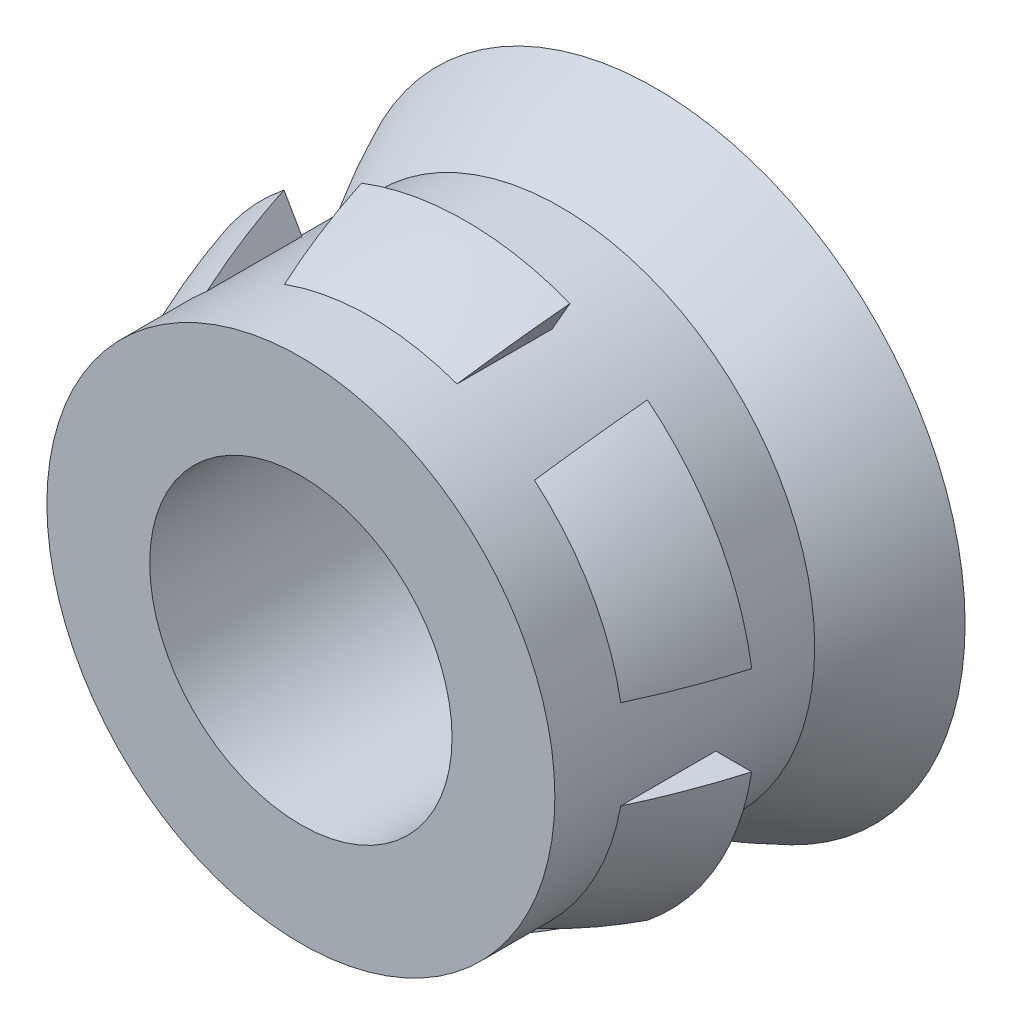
ISO-10303-21;
HEADER;
FILE_DESCRIPTION(('STEP AP214'),'2;1');
FILE_NAME('part.step','',(''),(''),'','','');
FILE_SCHEMA(('AUTOMOTIVE_DESIGN { 1 0 10303 214 1 1 1 1 }'));
ENDSEC;
DATA;
#1=APPLICATION_CONTEXT('core data for automotive mechanical design processes');
#2=APPLICATION_PROTOCOL_DEFINITION('international standard','automotive_design',2000,#1);
#3=PRODUCT_CONTEXT('',#1,'mechanical');
#4=PRODUCT('Part','Part','',(#3));
#5=PRODUCT_RELATED_PRODUCT_CATEGORY('part','',(#4));
#6=PRODUCT_DEFINITION_FORMATION('','',#4);
#7=PRODUCT_DEFINITION_CONTEXT('part definition',#1,'design');
#8=PRODUCT_DEFINITION('design','',#6,#7);
#9=PRODUCT_DEFINITION_SHAPE('','',#8);
#10=(LENGTH_UNIT() NAMED_UNIT(*) SI_UNIT(.MILLI.,.METRE.));
#11=(NAMED_UNIT(*) PLANE_ANGLE_UNIT() SI_UNIT($,.RADIAN.));
#12=(NAMED_UNIT(*) SI_UNIT($,.STERADIAN.) SOLID_ANGLE_UNIT());
#13=UNCERTAINTY_MEASURE_WITH_UNIT(LENGTH_MEASURE(1.E-05),#10,'distance_accuracy_value','');
#14=(GEOMETRIC_REPRESENTATION_CONTEXT(3) GLOBAL_UNCERTAINTY_ASSIGNED_CONTEXT((#13)) GLOBAL_UNIT_ASSIGNED_CONTEXT((#10,
#11,#12)) REPRESENTATION_CONTEXT('',''));
#15=CARTESIAN_POINT('',(0.,0.,0.));
#16=DIRECTION('',(0.,0.,1.));
#17=DIRECTION('',(1.,0.,0.));
#18=AXIS2_PLACEMENT_3D('',#15,#16,#17);
#19=CARTESIAN_POINT('',(9.23040234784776,0.,-55.1887828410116));
#20=DIRECTION('',(0.,0.,-1.));
#21=DIRECTION('',(-1.,0.,0.));
#22=AXIS2_PLACEMENT_3D('',#19,#20,#21);
#23=CYLINDRICAL_SURFACE('',#22,2.27274523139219);
#24=CARTESIAN_POINT('',(9.23040234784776,0.,-18.3276107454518));
#25=DIRECTION('',(0.,0.,-1.));
#26=DIRECTION('',(-1.,0.,0.));
#27=AXIS2_PLACEMENT_3D('',#24,#25,#26);
#28=CIRCLE('',#27,2.27274523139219);
#29=CARTESIAN_POINT('',(6.95765711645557,0.,-18.3276107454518));
#30=VERTEX_POINT('',#29);
#31=EDGE_CURVE('E195',#30,#30,#28,.T.);
#32=ORIENTED_EDGE('',*,*,#31,.F.);
#33=EDGE_LOOP('',(#32));
#34=FACE_BOUND('',#33,.T.);
#35=DIRECTION('',(0.,0.,1.));
#36=VECTOR('',#35,1.);
#37=CARTESIAN_POINT('',(10.6954468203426,-1.73753146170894,-17.8276107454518));
#38=LINE('',#37,#36);
#39=CARTESIAN_POINT('',(10.6954468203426,-1.73753146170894,-17.4776107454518));
#40=VERTEX_POINT('',#39);
#41=CARTESIAN_POINT('',(10.6954468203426,-1.73753146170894,-16.6276107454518));
#42=VERTEX_POINT('',#41);
#43=EDGE_CURVE('E350',#40,#42,#38,.T.);
#44=ORIENTED_EDGE('',*,*,#43,.T.);
#45=CARTESIAN_POINT('',(9.23040234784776,0.,-16.6276107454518));
#46=DIRECTION('',(0.,0.,-1.));
#47=DIRECTION('',(-1.,0.,0.));
#48=AXIS2_PLACEMENT_3D('',#45,#46,#47);
#49=CIRCLE('',#48,2.27274523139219);
#50=CARTESIAN_POINT('',(11.4676709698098,-0.4,-16.6276107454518));
#51=VERTEX_POINT('',#50);
#52=EDGE_CURVE('E11',#51,#42,#49,.T.);
#53=ORIENTED_EDGE('',*,*,#52,.F.);
#54=DIRECTION('',(0.,0.,1.));
#55=VECTOR('',#54,1.);
#56=CARTESIAN_POINT('',(11.4676709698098,-0.4,-17.8276107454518));
#57=LINE('',#56,#55);
#58=CARTESIAN_POINT('',(11.4676709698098,-0.4,-17.4776107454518));
#59=VERTEX_POINT('',#58);
#60=EDGE_CURVE('E312',#59,#51,#57,.T.);
#61=ORIENTED_EDGE('',*,*,#60,.F.);
#62=CARTESIAN_POINT('',(9.23040234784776,0.,-17.4776107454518));
#63=DIRECTION('',(0.,0.,-1.));
#64=DIRECTION('',(-1.,0.,0.));
#65=AXIS2_PLACEMENT_3D('',#62,#63,#64);
#66=CIRCLE('',#65,2.27274523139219);
#67=EDGE_CURVE('E190',#59,#40,#66,.T.);
#68=ORIENTED_EDGE('',*,*,#67,.T.);
#69=EDGE_LOOP('',(#44,#53,#61,#68));
#70=FACE_BOUND('',#69,.T.);
#71=DIRECTION('',(0.,0.,1.));
#72=VECTOR('',#71,1.);
#73=CARTESIAN_POINT('',(8.45817819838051,-2.13753146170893,-17.8276107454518));
#74=LINE('',#73,#72);
#75=CARTESIAN_POINT('',(8.45817819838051,-2.13753146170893,-17.4776107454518));
#76=VERTEX_POINT('',#75);
#77=CARTESIAN_POINT('',(8.45817819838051,-2.13753146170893,-16.6276107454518));
#78=VERTEX_POINT('',#77);
#79=EDGE_CURVE('E391',#76,#78,#74,.T.);
#80=ORIENTED_EDGE('',*,*,#79,.T.);
#81=CARTESIAN_POINT('',(10.002626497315,-2.13753146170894,-16.6276107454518));
#82=VERTEX_POINT('',#81);
#83=EDGE_CURVE('E46',#82,#78,#49,.T.);
#84=ORIENTED_EDGE('',*,*,#83,.F.);
#85=DIRECTION('',(0.,0.,1.));
#86=VECTOR('',#85,1.);
#87=CARTESIAN_POINT('',(10.002626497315,-2.13753146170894,-17.8276107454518));
#88=LINE('',#87,#86);
#89=CARTESIAN_POINT('',(10.002626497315,-2.13753146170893,-17.4776107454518));
#90=VERTEX_POINT('',#89);
#91=EDGE_CURVE('E349',#90,#82,#88,.T.);
#92=ORIENTED_EDGE('',*,*,#91,.F.);
#93=EDGE_CURVE('E193',#90,#76,#66,.T.);
#94=ORIENTED_EDGE('',*,*,#93,.T.);
#95=EDGE_LOOP('',(#80,#84,#92,#94));
#96=FACE_BOUND('',#95,.T.);
#97=DIRECTION('',(0.,0.,1.));
#98=VECTOR('',#97,1.);
#99=CARTESIAN_POINT('',(6.99313372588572,-0.4,-17.8276107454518));
#100=LINE('',#99,#98);
#101=CARTESIAN_POINT('',(6.99313372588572,-0.4,-17.4776107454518));
#102=VERTEX_POINT('',#101);
#103=CARTESIAN_POINT('',(6.99313372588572,-0.4,-16.6276107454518));
#104=VERTEX_POINT('',#103);
#105=EDGE_CURVE('E447',#102,#104,#100,.T.);
#106=ORIENTED_EDGE('',*,*,#105,.T.);
#107=CARTESIAN_POINT('',(7.76535787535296,-1.73753146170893,-16.6276107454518));
#108=VERTEX_POINT('',#107);
#109=EDGE_CURVE('E404',#108,#104,#49,.T.);
#110=ORIENTED_EDGE('',*,*,#109,.F.);
#111=DIRECTION('',(0.,0.,1.));
#112=VECTOR('',#111,1.);
#113=CARTESIAN_POINT('',(7.76535787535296,-1.73753146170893,-17.8276107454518));
#114=LINE('',#113,#112);
#115=CARTESIAN_POINT('',(7.76535787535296,-1.73753146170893,-17.4776107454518));
#116=VERTEX_POINT('',#115);
#117=EDGE_CURVE('E394',#116,#108,#114,.T.);
#118=ORIENTED_EDGE('',*,*,#117,.F.);
#119=EDGE_CURVE('E457',#116,#102,#66,.T.);
#120=ORIENTED_EDGE('',*,*,#119,.T.);
#121=EDGE_LOOP('',(#106,#110,#118,#120));
#122=FACE_BOUND('',#121,.T.);
#123=DIRECTION('',(0.,0.,1.));
#124=VECTOR('',#123,1.);
#125=CARTESIAN_POINT('',(7.76535787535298,1.73753146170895,-17.8276107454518));
#126=LINE('',#125,#124);
#127=CARTESIAN_POINT('',(7.76535787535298,1.73753146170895,-17.4776107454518));
#128=VERTEX_POINT('',#127);
#129=CARTESIAN_POINT('',(7.76535787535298,1.73753146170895,-16.6276107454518));
#130=VERTEX_POINT('',#129);
#131=EDGE_CURVE('E414',#128,#130,#126,.T.);
#132=ORIENTED_EDGE('',*,*,#131,.T.);
#133=CARTESIAN_POINT('',(6.99313372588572,0.4,-16.6276107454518));
#134=VERTEX_POINT('',#133);
#135=EDGE_CURVE('E185',#134,#130,#49,.T.);
#136=ORIENTED_EDGE('',*,*,#135,.F.);
#137=DIRECTION('',(0.,0.,1.));
#138=VECTOR('',#137,1.);
#139=CARTESIAN_POINT('',(6.99313372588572,0.4,-17.8276107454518));
#140=LINE('',#139,#138);
#141=CARTESIAN_POINT('',(6.99313372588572,0.4,-17.4776107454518));
#142=VERTEX_POINT('',#141);
#143=EDGE_CURVE('E413',#142,#134,#140,.T.);
#144=ORIENTED_EDGE('',*,*,#143,.F.);
#145=EDGE_CURVE('E415',#142,#128,#66,.T.);
#146=ORIENTED_EDGE('',*,*,#145,.T.);
#147=EDGE_LOOP('',(#132,#136,#144,#146));
#148=FACE_BOUND('',#147,.T.);
#149=DIRECTION('',(0.,0.,1.));
#150=VECTOR('',#149,1.);
#151=CARTESIAN_POINT('',(10.002626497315,2.13753146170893,-17.8276107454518));
#152=LINE('',#151,#150);
#153=CARTESIAN_POINT('',(10.002626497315,2.13753146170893,-17.4776107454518));
#154=VERTEX_POINT('',#153);
#155=CARTESIAN_POINT('',(10.002626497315,2.13753146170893,-16.6276107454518));
#156=VERTEX_POINT('',#155);
#157=EDGE_CURVE('E169',#154,#156,#152,.T.);
#158=ORIENTED_EDGE('',*,*,#157,.T.);
#159=CARTESIAN_POINT('',(8.45817819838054,2.13753146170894,-16.6276107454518));
#160=VERTEX_POINT('',#159);
#161=EDGE_CURVE('E182',#160,#156,#49,.T.);
#162=ORIENTED_EDGE('',*,*,#161,.F.);
#163=DIRECTION('',(0.,0.,1.));
#164=VECTOR('',#163,1.);
#165=CARTESIAN_POINT('',(8.45817819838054,2.13753146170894,-17.8276107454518));
#166=LINE('',#165,#164);
#167=CARTESIAN_POINT('',(8.45817819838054,2.13753146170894,-17.4776107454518));
#168=VERTEX_POINT('',#167);
#169=EDGE_CURVE('E62',#168,#160,#166,.T.);
#170=ORIENTED_EDGE('',*,*,#169,.F.);
#171=EDGE_CURVE('E460',#168,#154,#66,.T.);
#172=ORIENTED_EDGE('',*,*,#171,.T.);
#173=EDGE_LOOP('',(#158,#162,#170,#172));
#174=FACE_BOUND('',#173,.T.);
#175=CARTESIAN_POINT('',(10.6954468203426,1.73753146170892,-16.6276107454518));
#176=VERTEX_POINT('',#175);
#177=CARTESIAN_POINT('',(11.4676709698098,0.4,-16.6276107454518));
#178=VERTEX_POINT('',#177);
#179=EDGE_CURVE('E47',#176,#178,#49,.T.);
#180=ORIENTED_EDGE('',*,*,#179,.F.);
#181=DIRECTION('',(0.,0.,1.));
#182=VECTOR('',#181,1.);
#183=CARTESIAN_POINT('',(10.6954468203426,1.73753146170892,-17.8276107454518));
#184=LINE('',#183,#182);
#185=CARTESIAN_POINT('',(10.6954468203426,1.73753146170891,-17.4776107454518));
#186=VERTEX_POINT('',#185);
#187=EDGE_CURVE('E54',#186,#176,#184,.T.);
#188=ORIENTED_EDGE('',*,*,#187,.F.);
#189=CARTESIAN_POINT('',(11.4676709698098,0.4,-17.4776107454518));
#190=VERTEX_POINT('',#189);
#191=EDGE_CURVE('E194',#186,#190,#66,.T.);
#192=ORIENTED_EDGE('',*,*,#191,.T.);
#193=DIRECTION('',(0.,0.,1.));
#194=VECTOR('',#193,1.);
#195=CARTESIAN_POINT('',(11.4676709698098,0.4,-17.8276107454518));
#196=LINE('',#195,#194);
#197=EDGE_CURVE('E181',#190,#178,#196,.T.);
#198=ORIENTED_EDGE('',*,*,#197,.T.);
#199=EDGE_LOOP('',(#180,#188,#192,#198));
#200=FACE_BOUND('',#199,.T.);
#201=CARTESIAN_POINT('',(9.23040234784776,0.,-16.0026107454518));
#202=DIRECTION('',(0.,0.,1.));
#203=DIRECTION('',(1.,0.,0.));
#204=AXIS2_PLACEMENT_3D('',#201,#202,#203);
#205=CIRCLE('',#204,2.27274523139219);
#206=CARTESIAN_POINT('',(11.50314757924,0.,-16.0026107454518));
#207=VERTEX_POINT('',#206);
#208=EDGE_CURVE('E487',#207,#207,#205,.T.);
#209=ORIENTED_EDGE('',*,*,#208,.F.);
#210=EDGE_LOOP('',(#209));
#211=FACE_BOUND('',#210,.T.);
#212=ADVANCED_FACE('F36',(#34,#70,#96,#122,#148,#174,#200,#211),#23,.T.);
#213=CARTESIAN_POINT('',(9.23040234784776,0.,-19.1776107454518));
#214=DIRECTION('',(0.,0.,-1.));
#215=DIRECTION('',(-1.,0.,0.));
#216=AXIS2_PLACEMENT_3D('',#213,#214,#215);
#217=CYLINDRICAL_SURFACE('',#216,1.35255);
#218=CARTESIAN_POINT('',(9.23040234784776,0.,-18.858653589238));
#219=DIRECTION('',(0.,0.,-1.));
#220=DIRECTION('',(-1.,0.,0.));
#221=AXIS2_PLACEMENT_3D('',#218,#219,#220);
#222=CIRCLE('',#221,1.35255);
#223=CARTESIAN_POINT('',(7.87785234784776,0.,-18.858653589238));
#224=VERTEX_POINT('',#223);
#225=EDGE_CURVE('E201',#224,#224,#222,.T.);
#226=ORIENTED_EDGE('',*,*,#225,.T.);
#227=EDGE_LOOP('',(#226));
#228=FACE_BOUND('',#227,.T.);
#229=CARTESIAN_POINT('',(9.23040234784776,0.,-16.0026107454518));
#230=DIRECTION('',(0.,0.,1.));
#231=DIRECTION('',(1.,0.,0.));
#232=AXIS2_PLACEMENT_3D('',#229,#230,#231);
#233=CIRCLE('',#232,1.35255);
#234=CARTESIAN_POINT('',(10.5829523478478,0.,-16.0026107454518));
#235=VERTEX_POINT('',#234);
#236=EDGE_CURVE('E41',#235,#235,#233,.F.);
#237=ORIENTED_EDGE('',*,*,#236,.F.);
#238=EDGE_LOOP('',(#237));
#239=FACE_BOUND('',#238,.T.);
#240=ADVANCED_FACE('F229',(#228,#239),#217,.F.);
#241=CARTESIAN_POINT('',(9.23040234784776,0.,-19.082788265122));
#242=DIRECTION('',(0.,0.,-1.));
#243=DIRECTION('',(-1.,0.,0.));
#244=AXIS2_PLACEMENT_3D('',#241,#242,#243);
#245=DEGENERATE_TOROIDAL_SURFACE('',#244,3.00362568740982,5.81962084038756,.F.);
#246=ORIENTED_EDGE('',*,*,#161,.T.);
#247=CARTESIAN_POINT('',(10.0025792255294,2.13744958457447,-16.6274107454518));
#248=CARTESIAN_POINT('',(10.0350527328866,2.19369534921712,-16.7648757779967));
#249=CARTESIAN_POINT('',(10.0647085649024,2.24506075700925,-16.9044749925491));
#250=CARTESIAN_POINT('',(10.1183848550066,2.33803081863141,-17.1879416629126));
#251=CARTESIAN_POINT('',(10.1424053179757,2.37963548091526,-17.3318091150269));
#252=CARTESIAN_POINT('',(10.1636081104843,2.41635979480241,-17.4778107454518));
#253=B_SPLINE_CURVE_WITH_KNOTS('',3,(#247,#248,#249,#250,#251,#252),.UNSPECIFIED.,.F.,.F.,(4,2,
4),(0.,0.455030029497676,0.910059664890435),.UNSPECIFIED.);
#254=CARTESIAN_POINT('',(10.1635790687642,2.4163094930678,-17.4776107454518));
#255=VERTEX_POINT('',#254);
#256=EDGE_CURVE('E417',#156,#255,#253,.T.);
#257=ORIENTED_EDGE('',*,*,#256,.T.);
#258=CARTESIAN_POINT('',(9.23040234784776,0.,-17.4776107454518));
#259=DIRECTION('',(0.,0.,-1.));
#260=DIRECTION('',(-1.,0.,0.));
#261=AXIS2_PLACEMENT_3D('',#258,#259,#260);
#262=CIRCLE('',#261,2.59024523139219);
#263=CARTESIAN_POINT('',(8.29722562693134,2.41630949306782,-17.4776107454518));
#264=VERTEX_POINT('',#263);
#265=EDGE_CURVE('E299',#264,#255,#262,.T.);
#266=ORIENTED_EDGE('',*,*,#265,.F.);
#267=CARTESIAN_POINT('',(8.29719658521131,2.41635979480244,-17.4778107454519));
#268=CARTESIAN_POINT('',(8.31839937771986,2.37963548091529,-17.3318091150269));
#269=CARTESIAN_POINT('',(8.34241984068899,2.33803081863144,-17.1879416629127));
#270=CARTESIAN_POINT('',(8.39609613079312,2.24506075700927,-16.9044749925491));
#271=CARTESIAN_POINT('',(8.42575196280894,2.19369534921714,-16.7648757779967));
#272=CARTESIAN_POINT('',(8.45822547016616,2.13744958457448,-16.6274107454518));
#273=B_SPLINE_CURVE_WITH_KNOTS('',3,(#267,#268,#269,#270,#271,#272),.UNSPECIFIED.,.F.,.F.,(4,2,
4),(0.,0.455029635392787,0.910059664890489),.UNSPECIFIED.);
#274=EDGE_CURVE('E425',#264,#160,#273,.T.);
#275=ORIENTED_EDGE('',*,*,#274,.T.);
#276=EDGE_LOOP('',(#246,#257,#266,#275));
#277=FACE_BOUND('',#276,.T.);
#278=ADVANCED_FACE('F232',(#277),#245,.F.);
#279=CARTESIAN_POINT('',(11.50314757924,0.,-17.4776107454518));
#280=DIRECTION('',(0.,0.,1.));
#281=DIRECTION('',(1.,0.,0.));
#282=AXIS2_PLACEMENT_3D('',#279,#280,#281);
#283=PLANE('',#282);
#284=ORIENTED_EDGE('',*,*,#265,.T.);
#285=DIRECTION('',(-0.50000000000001,-0.866025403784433,0.));
#286=VECTOR('',#285,1.);
#287=CARTESIAN_POINT('',(9.45217849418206,1.18412755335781,-17.4776107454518));
#288=LINE('',#287,#286);
#289=EDGE_CURVE('E176',#255,#154,#288,.T.);
#290=ORIENTED_EDGE('',*,*,#289,.T.);
#291=ORIENTED_EDGE('',*,*,#171,.F.);
#292=DIRECTION('',(-0.499999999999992,0.866025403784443,0.));
#293=VECTOR('',#292,1.);
#294=CARTESIAN_POINT('',(10.1449988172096,-0.784127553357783,-17.4776107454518));
#295=LINE('',#294,#293);
#296=EDGE_CURVE('E419',#168,#264,#295,.T.);
#297=ORIENTED_EDGE('',*,*,#296,.T.);
#298=EDGE_LOOP('',(#284,#290,#291,#297));
#299=FACE_BOUND('',#298,.T.);
#300=ADVANCED_FACE('F246',(#299),#283,.F.);
#301=ORIENTED_EDGE('',*,*,#135,.T.);
#302=CARTESIAN_POINT('',(7.76540514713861,1.73744958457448,-16.6274107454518));
#303=CARTESIAN_POINT('',(7.73293163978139,1.79369534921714,-16.7648757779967));
#304=CARTESIAN_POINT('',(7.70327580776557,1.84506075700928,-16.9044749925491));
#305=CARTESIAN_POINT('',(7.64959951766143,1.93803081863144,-17.1879416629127));
#306=CARTESIAN_POINT('',(7.62557905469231,1.9796354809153,-17.3318091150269));
#307=CARTESIAN_POINT('',(7.60437626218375,2.01635979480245,-17.4778107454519));
#308=B_SPLINE_CURVE_WITH_KNOTS('',3,(#302,#303,#304,#305,#306,#307),.UNSPECIFIED.,.F.,.F.,(4,2,
4),(0.,0.455030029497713,0.910059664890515),.UNSPECIFIED.);
#309=CARTESIAN_POINT('',(7.60440530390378,2.01630949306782,-17.4776107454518));
#310=VERTEX_POINT('',#309);
#311=EDGE_CURVE('E409',#130,#310,#308,.T.);
#312=ORIENTED_EDGE('',*,*,#311,.T.);
#313=CARTESIAN_POINT('',(6.67122858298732,0.4,-17.4776107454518));
#314=VERTEX_POINT('',#313);
#315=EDGE_CURVE('E290',#314,#310,#262,.T.);
#316=ORIENTED_EDGE('',*,*,#315,.F.);
#317=CARTESIAN_POINT('',(6.81334382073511,0.4,-17.051364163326));
#318=CARTESIAN_POINT('',(6.86771533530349,0.4,-16.9073568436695));
#319=CARTESIAN_POINT('',(6.927894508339,0.4,-16.7655418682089));
#320=CARTESIAN_POINT('',(7.0595245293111,0.4,-16.4872441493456));
#321=CARTESIAN_POINT('',(7.13097525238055,0.4,-16.3507613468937));
#322=CARTESIAN_POINT('',(7.28490263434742,0.4,-16.0838210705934));
#323=CARTESIAN_POINT('',(7.36739914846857,0.4,-15.9533750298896));
#324=CARTESIAN_POINT('',(7.54285831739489,0.4,-15.6998280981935));
#325=CARTESIAN_POINT('',(7.63581580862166,0.4,-15.5767236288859));
#326=CARTESIAN_POINT('',(7.84084675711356,0.4,-15.3279294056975));
#327=CARTESIAN_POINT('',(7.95389076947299,0.4,-15.2030310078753));
#328=CARTESIAN_POINT('',(8.13210955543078,0.4,-15.0249272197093));
#329=CARTESIAN_POINT('',(8.19282459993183,0.4,-14.9672089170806));
#330=CARTESIAN_POINT('',(8.31730520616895,0.4,-14.855167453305));
#331=CARTESIAN_POINT('',(8.3810697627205,0.4,-14.8008431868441));
#332=CARTESIAN_POINT('',(8.49698448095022,0.4,-14.7083319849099));
#333=CARTESIAN_POINT('',(8.54845713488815,0.4,-14.6692951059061));
#334=CARTESIAN_POINT('',(8.65407315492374,0.4,-14.5941860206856));
#335=CARTESIAN_POINT('',(8.70823156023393,0.4,-14.5581344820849));
#336=CARTESIAN_POINT('',(8.79216461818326,0.4,-14.5075752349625));
#337=CARTESIAN_POINT('',(8.82081159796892,0.4,-14.4912018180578));
#338=CARTESIAN_POINT('',(8.87908250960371,0.4,-14.4602028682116));
#339=CARTESIAN_POINT('',(8.90870724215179,0.4,-14.4455788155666));
#340=CARTESIAN_POINT('',(8.96876265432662,0.4,-14.418968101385));
#341=CARTESIAN_POINT('',(8.99918138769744,0.4,-14.4069550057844));
#342=CARTESIAN_POINT('',(9.06119761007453,0.4,-14.3865272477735));
#343=CARTESIAN_POINT('',(9.09279236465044,0.4,-14.3781047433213));
#344=CARTESIAN_POINT('',(9.14324624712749,0.4,-14.368764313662));
#345=CARTESIAN_POINT('',(9.16179629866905,0.4,-14.3661779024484));
#346=CARTESIAN_POINT('',(9.19906261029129,0.4,-14.362843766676));
#347=CARTESIAN_POINT('',(9.21777883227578,0.4,-14.3620956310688));
#348=CARTESIAN_POINT('',(9.25518432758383,0.4,-14.3625054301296));
#349=CARTESIAN_POINT('',(9.27387360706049,0.4,-14.3636628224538));
#350=CARTESIAN_POINT('',(9.31105269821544,0.4,-14.3677803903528));
#351=CARTESIAN_POINT('',(9.32954244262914,0.4,-14.3707411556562));
#352=CARTESIAN_POINT('',(9.37258796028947,0.4,-14.3795521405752));
#353=CARTESIAN_POINT('',(9.39700988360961,0.4,-14.3860500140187));
#354=CARTESIAN_POINT('',(9.44514557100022,0.4,-14.4012714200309));
#355=CARTESIAN_POINT('',(9.46885879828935,0.4,-14.4099965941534));
#356=CARTESIAN_POINT('',(9.51577848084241,0.4,-14.4291822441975));
#357=CARTESIAN_POINT('',(9.5389795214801,0.4,-14.4396557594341));
#358=CARTESIAN_POINT('',(9.5847504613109,0.4,-14.461870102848));
#359=CARTESIAN_POINT('',(9.60732053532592,0.4,-14.4736105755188));
#360=CARTESIAN_POINT('',(9.6669831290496,0.4,-14.506325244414));
#361=CARTESIAN_POINT('',(9.70359052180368,0.4,-14.5281811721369));
#362=CARTESIAN_POINT('',(9.77559993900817,0.4,-14.5738091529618));
#363=CARTESIAN_POINT('',(9.81100125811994,0.4,-14.5975823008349));
#364=CARTESIAN_POINT('',(9.88082390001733,0.4,-14.6466383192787));
#365=CARTESIAN_POINT('',(9.91524354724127,0.4,-14.6719235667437));
#366=CARTESIAN_POINT('',(9.98315883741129,0.4,-14.7237090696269));
#367=CARTESIAN_POINT('',(10.0166543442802,0.4,-14.7502095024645));
#368=CARTESIAN_POINT('',(10.115898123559,0.4,-14.8313034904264));
#369=CARTESIAN_POINT('',(10.1803706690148,0.4,-14.8874660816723));
#370=CARTESIAN_POINT('',(10.3060908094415,0.4,-15.0031418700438));
#371=CARTESIAN_POINT('',(10.3673414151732,0.4,-15.0626518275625));
#372=CARTESIAN_POINT('',(10.5332998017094,0.4,-15.2322150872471));
#373=CARTESIAN_POINT('',(10.6346988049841,0.4,-15.3455346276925));
#374=CARTESIAN_POINT('',(10.8277135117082,0.4,-15.5803237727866));
#375=CARTESIAN_POINT('',(10.919321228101,0.4,-15.7017999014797));
#376=CARTESIAN_POINT('',(11.0921832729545,0.4,-15.9516237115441));
#377=CARTESIAN_POINT('',(11.1734538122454,0.4,-16.0799601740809));
#378=CARTESIAN_POINT('',(11.3253981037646,0.4,-16.3427092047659));
#379=CARTESIAN_POINT('',(11.3960745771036,0.4,-16.4771202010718));
#380=CARTESIAN_POINT('',(11.5277314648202,0.4,-16.7537702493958));
#381=CARTESIAN_POINT('',(11.5885007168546,0.4,-16.8961098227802));
#382=CARTESIAN_POINT('',(11.6983418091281,0.4,-17.1852843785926));
#383=CARTESIAN_POINT('',(11.74740978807,0.4,-17.3321208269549));
#384=CARTESIAN_POINT('',(11.8335713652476,0.4,-17.6294045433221));
#385=CARTESIAN_POINT('',(11.8706545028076,0.4,-17.7798548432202));
#386=CARTESIAN_POINT('',(11.9325661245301,0.4,-18.0832569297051));
#387=CARTESIAN_POINT('',(11.9573943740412,0.4,-18.2362087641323));
#388=CARTESIAN_POINT('',(11.9954392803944,0.4,-18.5501736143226));
#389=CARTESIAN_POINT('',(12.0081158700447,0.4,-18.7112523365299));
#390=CARTESIAN_POINT('',(12.0198960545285,0.4,-19.0338522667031));
#391=CARTESIAN_POINT('',(12.0190039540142,0.4,-19.1953733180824));
#392=CARTESIAN_POINT('',(12.0036705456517,0.4,-19.5176255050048));
#393=CARTESIAN_POINT('',(11.9892414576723,0.4,-19.6783572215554));
#394=CARTESIAN_POINT('',(11.9469545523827,0.4,-19.9979821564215));
#395=CARTESIAN_POINT('',(11.9191018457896,0.4,-20.1568760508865));
#396=CARTESIAN_POINT('',(11.8500577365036,0.4,-20.4721951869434));
#397=CARTESIAN_POINT('',(11.8088300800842,0.4,-20.628612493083));
#398=CARTESIAN_POINT('',(11.7133212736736,0.4,-20.9374290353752));
#399=CARTESIAN_POINT('',(11.6590387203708,0.4,-21.0898278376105));
#400=CARTESIAN_POINT('',(11.5375371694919,0.4,-21.3900613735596));
#401=CARTESIAN_POINT('',(11.4702693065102,0.4,-21.5378763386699));
#402=CARTESIAN_POINT('',(11.3233750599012,0.4,-21.827178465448));
#403=CARTESIAN_POINT('',(11.243752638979,0.4,-21.9686676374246));
#404=CARTESIAN_POINT('',(11.0728744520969,0.4,-22.2438195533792));
#405=CARTESIAN_POINT('',(10.9816558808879,0.4,-22.3775054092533));
#406=CARTESIAN_POINT('',(10.7877338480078,0.4,-22.6365472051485));
#407=CARTESIAN_POINT('',(10.6850182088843,0.4,-22.7618940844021));
#408=CARTESIAN_POINT('',(10.5230630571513,0.4,-22.9420106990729));
#409=CARTESIAN_POINT('',(10.4679653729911,0.4,-23.0005461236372));
#410=CARTESIAN_POINT('',(10.3550199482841,0.4,-23.114945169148));
#411=CARTESIAN_POINT('',(10.2971715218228,0.4,-23.1708081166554));
#412=CARTESIAN_POINT('',(10.1787949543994,0.4,-23.2793776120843));
#413=CARTESIAN_POINT('',(10.1182723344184,0.4,-23.3320901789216));
#414=CARTESIAN_POINT('',(9.99426471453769,0.4,-23.4338810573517));
#415=CARTESIAN_POINT('',(9.93078158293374,0.4,-23.4829616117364));
#416=CARTESIAN_POINT('',(9.84267839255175,0.4,-23.5458887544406));
#417=CARTESIAN_POINT('',(9.81960488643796,0.4,-23.5619100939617));
#418=CARTESIAN_POINT('',(9.7729706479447,0.4,-23.5932306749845));
#419=CARTESIAN_POINT('',(9.74940991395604,0.4,-23.6085299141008));
#420=CARTESIAN_POINT('',(9.70168205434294,0.4,-23.6382958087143));
#421=CARTESIAN_POINT('',(9.67751355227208,0.4,-23.6527602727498));
#422=CARTESIAN_POINT('',(9.62854648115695,0.4,-23.6805754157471));
#423=CARTESIAN_POINT('',(9.60374797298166,0.4,-23.6939262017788));
#424=CARTESIAN_POINT('',(9.53811023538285,0.4,-23.7268825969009));
#425=CARTESIAN_POINT('',(9.49668371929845,0.4,-23.7453569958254));
#426=CARTESIAN_POINT('',(9.41165134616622,0.4,-23.7760340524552));
#427=CARTESIAN_POINT('',(9.36805966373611,0.4,-23.7882727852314));
#428=CARTESIAN_POINT('',(9.2898781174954,0.4,-23.8010975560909));
#429=CARTESIAN_POINT('',(9.25565873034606,0.4,-23.8037849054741));
#430=CARTESIAN_POINT('',(9.18734123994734,0.4,-23.8026908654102));
#431=CARTESIAN_POINT('',(9.15324312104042,0.4,-23.7989103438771));
#432=CARTESIAN_POINT('',(9.0725081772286,0.4,-23.7833160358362));
#433=CARTESIAN_POINT('',(9.02641186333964,0.4,-23.7688604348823));
#434=CARTESIAN_POINT('',(8.95915276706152,0.4,-23.7424243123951));
#435=CARTESIAN_POINT('',(8.93696225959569,0.4,-23.7327718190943));
#436=CARTESIAN_POINT('',(8.89315477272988,0.4,-23.7122354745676));
#437=CARTESIAN_POINT('',(8.87153764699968,0.4,-23.7013519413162));
#438=CARTESIAN_POINT('',(8.81439844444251,0.4,-23.6709763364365));
#439=CARTESIAN_POINT('',(8.77933525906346,0.4,-23.6506304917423));
#440=CARTESIAN_POINT('',(8.71034631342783,0.4,-23.6080801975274));
#441=CARTESIAN_POINT('',(8.6764211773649,0.4,-23.5858747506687));
#442=CARTESIAN_POINT('',(8.6094894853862,0.4,-23.5400084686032));
#443=CARTESIAN_POINT('',(8.57648458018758,0.4,-23.51634523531));
#444=CARTESIAN_POINT('',(8.51133760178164,0.4,-23.4678563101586));
#445=CARTESIAN_POINT('',(8.47919565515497,0.4,-23.4430304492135));
#446=CARTESIAN_POINT('',(8.38384662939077,0.4,-23.3669828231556));
#447=CARTESIAN_POINT('',(8.32182545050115,0.4,-23.3142674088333));
#448=CARTESIAN_POINT('',(8.20074631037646,0.4,-23.205686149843));
#449=CARTESIAN_POINT('',(8.14168548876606,0.4,-23.1498234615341));
#450=CARTESIAN_POINT('',(7.97667397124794,0.4,-22.985952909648));
#451=CARTESIAN_POINT('',(7.8741450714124,0.4,-22.8744690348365));
#452=CARTESIAN_POINT('',(7.67874222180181,0.4,-22.6432293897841));
#453=CARTESIAN_POINT('',(7.58587670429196,0.4,-22.5234665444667));
#454=CARTESIAN_POINT('',(7.41040194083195,0.4,-22.2770232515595));
#455=CARTESIAN_POINT('',(7.32777177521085,0.4,-22.1503577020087));
#456=CARTESIAN_POINT('',(7.1729521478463,0.4,-21.8908546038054));
#457=CARTESIAN_POINT('',(7.10075975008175,0.4,-21.7580188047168));
#458=CARTESIAN_POINT('',(6.96595756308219,0.4,-21.4845924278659));
#459=CARTESIAN_POINT('',(6.90354346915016,0.4,-21.3439053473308));
#460=CARTESIAN_POINT('',(6.79022614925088,0.4,-21.0579186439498));
#461=CARTESIAN_POINT('',(6.7393266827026,0.4,-20.9126175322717));
#462=CARTESIAN_POINT('',(6.64931184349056,0.4,-20.618240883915));
#463=CARTESIAN_POINT('',(6.61020905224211,0.4,-20.4691614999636));
#464=CARTESIAN_POINT('',(6.54409144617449,0.4,-20.1683449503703));
#465=CARTESIAN_POINT('',(6.51707688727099,0.4,-20.0166077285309));
#466=CARTESIAN_POINT('',(6.47429482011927,0.4,-19.7041231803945));
#467=CARTESIAN_POINT('',(6.45912963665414,0.4,-19.5432930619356));
#468=CARTESIAN_POINT('',(6.44235883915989,0.4,-19.2209798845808));
#469=CARTESIAN_POINT('',(6.44074898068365,0.4,-19.0594970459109));
#470=CARTESIAN_POINT('',(6.45108002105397,0.4,-18.737200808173));
#471=CARTESIAN_POINT('',(6.46300119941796,0.4,-18.5763867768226));
#472=CARTESIAN_POINT('',(6.5002777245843,0.4,-18.2563832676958));
#473=CARTESIAN_POINT('',(6.5256279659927,0.4,-18.0971931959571));
#474=CARTESIAN_POINT('',(6.58822691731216,0.4,-17.7882398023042));
#475=CARTESIAN_POINT('',(6.62492196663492,0.4,-17.6383640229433));
#476=CARTESIAN_POINT('',(6.71025038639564,0.4,-17.3420470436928));
#477=CARTESIAN_POINT('',(6.7588838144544,0.4,-17.1956058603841));
#478=CARTESIAN_POINT('',(6.81334382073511,0.4,-17.051364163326));
#479=B_SPLINE_CURVE_WITH_KNOTS('',3,(#317,#318,#319,#320,#321,#322,#323,#324,#325,#326,#327,
#328,#329,#330,#331,#332,#333,#334,#335,#336,#337,#338,#339,#340,#341,#342,#343,#344,#345,#346,
#347,#348,#349,#350,#351,#352,#353,#354,#355,#356,#357,#358,#359,#360,#361,#362,#363,#364,#365,
#366,#367,#368,#369,#370,#371,#372,#373,#374,#375,#376,#377,#378,#379,#380,#381,#382,#383,#384,
#385,#386,#387,#388,#389,#390,#391,#392,#393,#394,#395,#396,#397,#398,#399,#400,#401,#402,#403,
#404,#405,#406,#407,#408,#409,#410,#411,#412,#413,#414,#415,#416,#417,#418,#419,#420,#421,#422,
#423,#424,#425,#426,#427,#428,#429,#430,#431,#432,#433,#434,#435,#436,#437,#438,#439,#440,#441,
#442,#443,#444,#445,#446,#447,#448,#449,#450,#451,#452,#453,#454,#455,#456,#457,#458,#459,#460,
#461,#462,#463,#464,#465,#466,#467,#468,#469,#470,#471,#472,#473,#474,#475,#476,#477,#478),
.UNSPECIFIED.,.T.,.F.,(4,2,2,2,2,2,2,2,2,2,2,2,2,2,2,2,2,2,2,2,2,2,2,2,2,2,2,2,2,2,2,2,2,2,2,2,
2,2,2,2,2,2,2,2,2,2,2,2,2,2,2,2,2,2,2,2,2,2,2,2,2,2,2,2,2,2,2,2,2,2,2,2,2,2,2,2,2,2,2,2,4),(0.,
0.461663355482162,0.923321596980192,1.38582111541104,1.84809333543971,2.35259962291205,
2.6038242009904,2.85496653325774,3.04869267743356,3.24366396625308,3.3426104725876,
3.44164012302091,3.53961491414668,3.63737461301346,3.69348341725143,3.74957967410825,
3.80565996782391,3.86175861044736,3.93742603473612,4.0131493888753,4.08946503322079,
4.16575931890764,4.29357275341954,4.42145969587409,4.5495532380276,4.67766554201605,
4.93401168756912,5.19011387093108,5.64568287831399,6.1016207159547,6.55683449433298,
7.01193114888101,7.47572690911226,7.93967550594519,8.40402796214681,8.86838930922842,
9.352544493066,9.83654608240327,10.3201111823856,10.8034923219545,11.2881948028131,
11.7729494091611,12.2595650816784,12.7460249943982,13.2309621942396,13.7164179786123,
13.9575084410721,14.1986593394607,14.4393337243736,14.6798582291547,14.7641193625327,
14.8483807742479,14.9328541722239,15.0173194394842,15.1531297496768,15.2881451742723,
15.3905314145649,15.4929039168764,15.6369113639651,15.7094989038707,15.7820677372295,
15.9035988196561,16.0251955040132,16.1469978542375,16.2688179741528,16.5128569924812,
16.7566554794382,17.2104131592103,17.6645635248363,18.1177697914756,18.5708483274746,
19.0320755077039,19.4934530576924,19.9553209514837,20.4171986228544,20.9012539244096,
21.3851576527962,21.8683570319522,22.351372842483,22.8137853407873,23.2762000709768),.UNSPECIFIED.);
#480=EDGE_CURVE('E410',#314,#134,#479,.T.);
#481=ORIENTED_EDGE('',*,*,#480,.T.);
#482=EDGE_LOOP('',(#301,#312,#316,#481));
#483=FACE_BOUND('',#482,.T.);
#484=ADVANCED_FACE('F253',(#483),#245,.F.);
#485=ORIENTED_EDGE('',*,*,#315,.T.);
#486=DIRECTION('',(0.499999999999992,-0.866025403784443,0.));
#487=VECTOR('',#486,1.);
#488=CARTESIAN_POINT('',(9.45217849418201,-1.18412755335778,-17.4776107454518));
#489=LINE('',#488,#487);
#490=EDGE_CURVE('E292',#310,#128,#489,.T.);
#491=ORIENTED_EDGE('',*,*,#490,.T.);
#492=ORIENTED_EDGE('',*,*,#145,.F.);
#493=DIRECTION('',(-1.,0.,0.));
#494=VECTOR('',#493,1.);
#495=CARTESIAN_POINT('',(11.50314757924,0.4,-17.4776107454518));
#496=LINE('',#495,#494);
#497=EDGE_CURVE('E295',#142,#314,#496,.T.);
#498=ORIENTED_EDGE('',*,*,#497,.T.);
#499=EDGE_LOOP('',(#485,#491,#492,#498));
#500=FACE_BOUND('',#499,.T.);
#501=ADVANCED_FACE('F255',(#500),#283,.F.);
#502=ORIENTED_EDGE('',*,*,#109,.T.);
#503=CARTESIAN_POINT('',(6.81334382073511,-0.4,-17.051364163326));
#504=CARTESIAN_POINT('',(6.75900903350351,-0.4,-17.1952747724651));
#505=CARTESIAN_POINT('',(6.71047186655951,-0.4,-17.3413802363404));
#506=CARTESIAN_POINT('',(6.62526700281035,-0.4,-17.6370641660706));
#507=CARTESIAN_POINT('',(6.58860352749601,-0.4,-17.7866438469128));
#508=CARTESIAN_POINT('',(6.52734909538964,-0.4,-18.0884388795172));
#509=CARTESIAN_POINT('',(6.50277235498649,-0.4,-18.240657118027));
#510=CARTESIAN_POINT('',(6.46589640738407,-0.4,-18.5466283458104));
#511=CARTESIAN_POINT('',(6.45360174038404,-0.4,-18.7003818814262));
#512=CARTESIAN_POINT('',(6.44108297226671,-0.4,-19.0158761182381));
#513=CARTESIAN_POINT('',(6.44147496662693,-0.4,-19.1776416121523));
#514=CARTESIAN_POINT('',(6.45586040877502,-0.4,-19.5006280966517));
#515=CARTESIAN_POINT('',(6.46985916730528,-0.4,-19.6618488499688));
#516=CARTESIAN_POINT('',(6.51136090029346,-0.4,-19.982448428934));
#517=CARTESIAN_POINT('',(6.53885603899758,-0.4,-20.1418282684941));
#518=CARTESIAN_POINT('',(6.60717807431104,-0.4,-20.457763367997));
#519=CARTESIAN_POINT('',(6.64800965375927,-0.4,-20.6143176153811));
#520=CARTESIAN_POINT('',(6.74278753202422,-0.4,-20.9235925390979));
#521=CARTESIAN_POINT('',(6.79674804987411,-0.4,-21.0763088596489));
#522=CARTESIAN_POINT('',(6.9174403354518,-0.4,-21.3766880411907));
#523=CARTESIAN_POINT('',(6.98417779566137,-0.4,-21.5243486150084));
#524=CARTESIAN_POINT('',(7.12998189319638,-0.4,-21.8134262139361));
#525=CARTESIAN_POINT('',(7.20904621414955,-0.4,-21.954844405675));
#526=CARTESIAN_POINT('',(7.37904474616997,-0.4,-22.2303546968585));
#527=CARTESIAN_POINT('',(7.46997992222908,-0.4,-22.3644461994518));
#528=CARTESIAN_POINT('',(7.67929937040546,-0.4,-22.6457328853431));
#529=CARTESIAN_POINT('',(7.79973540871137,-0.4,-22.7914201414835));
#530=CARTESIAN_POINT('',(7.99134632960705,-0.4,-22.9992929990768));
#531=CARTESIAN_POINT('',(8.05692793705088,-0.4,-23.0667071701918));
#532=CARTESIAN_POINT('',(8.1918384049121,-0.4,-23.1976695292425));
#533=CARTESIAN_POINT('',(8.26116607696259,-0.4,-23.2612189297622));
#534=CARTESIAN_POINT('',(8.38671670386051,-0.4,-23.3690536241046));
#535=CARTESIAN_POINT('',(8.44210715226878,-0.4,-23.4143105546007));
#536=CARTESIAN_POINT('',(8.55568358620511,-0.4,-23.5017409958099));
#537=CARTESIAN_POINT('',(8.61388031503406,-0.4,-23.5439007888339));
#538=CARTESIAN_POINT('',(8.70382938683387,-0.4,-23.6037611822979));
#539=CARTESIAN_POINT('',(8.73440182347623,-0.4,-23.6232332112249));
#540=CARTESIAN_POINT('',(8.79653418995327,-0.4,-23.6606053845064));
#541=CARTESIAN_POINT('',(8.82809484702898,-0.4,-23.6785043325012));
#542=CARTESIAN_POINT('',(8.89221338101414,-0.4,-23.7120079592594));
#543=CARTESIAN_POINT('',(8.92476482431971,-0.4,-23.7276247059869));
#544=CARTESIAN_POINT('',(8.99119719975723,-0.4,-23.7556255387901));
#545=CARTESIAN_POINT('',(9.02507580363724,-0.4,-23.76801501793));
#546=CARTESIAN_POINT('',(9.09782200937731,-0.4,-23.7888828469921));
#547=CARTESIAN_POINT('',(9.13685094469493,-0.4,-23.7968506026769));
#548=CARTESIAN_POINT('',(9.19589052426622,-0.4,-23.8025832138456));
#549=CARTESIAN_POINT('',(9.21560890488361,-0.4,-23.8034624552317));
#550=CARTESIAN_POINT('',(9.25502728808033,-0.4,-23.8031126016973));
#551=CARTESIAN_POINT('',(9.27472728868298,-0.4,-23.8018833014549));
#552=CARTESIAN_POINT('',(9.33317422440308,-0.4,-23.7952098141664));
#553=CARTESIAN_POINT('',(9.37159750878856,-0.4,-23.7868092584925));
#554=CARTESIAN_POINT('',(9.42797906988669,-0.4,-23.769960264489));
#555=CARTESIAN_POINT('',(9.44664002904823,-0.4,-23.7635999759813));
#556=CARTESIAN_POINT('',(9.48354054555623,-0.4,-23.7497431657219));
#557=CARTESIAN_POINT('',(9.50178012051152,-0.4,-23.7422466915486));
#558=CARTESIAN_POINT('',(9.547568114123,-0.4,-23.7220702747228));
#559=CARTESIAN_POINT('',(9.57484139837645,-0.4,-23.7087725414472));
#560=CARTESIAN_POINT('',(9.62858324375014,-0.4,-23.6806289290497));
#561=CARTESIAN_POINT('',(9.65505132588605,-0.4,-23.6657821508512));
#562=CARTESIAN_POINT('',(9.73352111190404,-0.4,-23.6194564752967));
#563=CARTESIAN_POINT('',(9.78449295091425,-0.4,-23.5862377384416));
#564=CARTESIAN_POINT('',(9.88447600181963,-0.4,-23.5166736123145));
#565=CARTESIAN_POINT('',(9.93347966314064,-0.4,-23.4803176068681));
#566=CARTESIAN_POINT('',(10.0296022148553,-0.4,-23.40530719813));
#567=CARTESIAN_POINT('',(10.0767231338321,-0.4,-23.3666553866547));
#568=CARTESIAN_POINT('',(10.1759503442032,-0.4,-23.2817034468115));
#569=CARTESIAN_POINT('',(10.227798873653,-0.4,-23.235102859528));
#570=CARTESIAN_POINT('',(10.3294139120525,-0.4,-23.1396781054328));
#571=CARTESIAN_POINT('',(10.3791800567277,-0.4,-23.0908535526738));
#572=CARTESIAN_POINT('',(10.5254961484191,-0.4,-22.9412844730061));
#573=CARTESIAN_POINT('',(10.6189811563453,-0.4,-22.837516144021));
#574=CARTESIAN_POINT('',(10.7974110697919,-0.4,-22.6233775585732));
#575=CARTESIAN_POINT('',(10.8823779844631,-0.4,-22.5130255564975));
#576=CARTESIAN_POINT('',(11.0437584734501,-0.4,-22.2863325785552));
#577=CARTESIAN_POINT('',(11.1201753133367,-0.4,-22.1699939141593));
#578=CARTESIAN_POINT('',(11.3442049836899,-0.4,-21.7997647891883));
#579=CARTESIAN_POINT('',(11.4767048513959,-0.4,-21.5365171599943));
#580=CARTESIAN_POINT('',(11.699834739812,-0.4,-20.9925460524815));
#581=CARTESIAN_POINT('',(11.7904185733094,-0.4,-20.7118036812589));
#582=CARTESIAN_POINT('',(11.8964808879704,-0.4,-20.2698311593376));
#583=CARTESIAN_POINT('',(11.9273891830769,-0.4,-20.1121554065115));
#584=CARTESIAN_POINT('',(11.9759305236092,-0.4,-19.7947317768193));
#585=CARTESIAN_POINT('',(11.9935627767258,-0.4,-19.6349837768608));
#586=CARTESIAN_POINT('',(12.015414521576,-0.4,-19.3146413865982));
#587=CARTESIAN_POINT('',(12.0196390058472,-0.4,-19.1540473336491));
#588=CARTESIAN_POINT('',(12.0146659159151,-0.4,-18.8330667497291));
#589=CARTESIAN_POINT('',(12.0054684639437,-0.4,-18.6726802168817));
#590=CARTESIAN_POINT('',(11.97358103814,-0.4,-18.3519341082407));
#591=CARTESIAN_POINT('',(11.950781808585,-0.4,-18.1915853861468));
#592=CARTESIAN_POINT('',(11.8917633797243,-0.4,-17.8734368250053));
#593=CARTESIAN_POINT('',(11.8555490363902,-0.4,-17.7156360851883));
#594=CARTESIAN_POINT('',(11.7698687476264,-0.4,-17.4034040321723));
#595=CARTESIAN_POINT('',(11.7203818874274,-0.4,-17.2489784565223));
#596=CARTESIAN_POINT('',(11.608524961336,-0.4,-16.9449319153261));
#597=CARTESIAN_POINT('',(11.5461598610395,-0.4,-16.7953091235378));
#598=CARTESIAN_POINT('',(11.4089871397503,-0.4,-16.5020328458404));
#599=CARTESIAN_POINT('',(11.3341900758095,-0.4,-16.3583744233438));
#600=CARTESIAN_POINT('',(11.1725436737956,-0.4,-16.0779463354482));
#601=CARTESIAN_POINT('',(11.0856910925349,-0.4,-15.9411785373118));
#602=CARTESIAN_POINT('',(10.9007026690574,-0.4,-15.676108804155));
#603=CARTESIAN_POINT('',(10.8026012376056,-0.4,-15.5477828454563));
#604=CARTESIAN_POINT('',(10.5953891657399,-0.4,-15.3004544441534));
#605=CARTESIAN_POINT('',(10.4862875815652,-0.4,-15.1814444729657));
#606=CARTESIAN_POINT('',(10.310096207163,-0.4,-15.0069756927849));
#607=CARTESIAN_POINT('',(10.2468875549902,-0.4,-14.9475609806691));
#608=CARTESIAN_POINT('',(10.1171502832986,-0.4,-14.8324181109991));
#609=CARTESIAN_POINT('',(10.0506214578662,-0.4,-14.7766901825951));
#610=CARTESIAN_POINT('',(9.95051371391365,-0.4,-14.698543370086));
#611=CARTESIAN_POINT('',(9.91837393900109,-0.4,-14.6742721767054));
#612=CARTESIAN_POINT('',(9.85321585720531,-0.4,-14.6269433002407));
#613=CARTESIAN_POINT('',(9.82019769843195,-0.4,-14.6038854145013));
#614=CARTESIAN_POINT('',(9.75313095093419,-0.4,-14.5592608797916));
#615=CARTESIAN_POINT('',(9.7190817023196,-0.4,-14.537695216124));
#616=CARTESIAN_POINT('',(9.64978835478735,-0.4,-14.4965971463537));
#617=CARTESIAN_POINT('',(9.6145449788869,-0.4,-14.4770635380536));
#618=CARTESIAN_POINT('',(9.54212914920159,-0.4,-14.4407198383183));
#619=CARTESIAN_POINT('',(9.5049389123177,-0.4,-14.4239443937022));
#620=CARTESIAN_POINT('',(9.42877637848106,-0.4,-14.395196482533));
#621=CARTESIAN_POINT('',(9.38981057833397,-0.4,-14.3832078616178));
#622=CARTESIAN_POINT('',(9.31756198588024,-0.4,-14.3681893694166));
#623=CARTESIAN_POINT('',(9.28455451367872,-0.4,-14.3639160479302));
#624=CARTESIAN_POINT('',(9.21835501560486,-0.4,-14.3614168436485));
#625=CARTESIAN_POINT('',(9.18516342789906,-0.4,-14.3631801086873));
#626=CARTESIAN_POINT('',(9.10964729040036,-0.4,-14.3736186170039));
#627=CARTESIAN_POINT('',(9.06760394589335,-0.4,-14.3842269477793));
#628=CARTESIAN_POINT('',(9.00609596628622,-0.4,-14.404786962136));
#629=CARTESIAN_POINT('',(8.98577540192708,-0.4,-14.4124546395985));
#630=CARTESIAN_POINT('',(8.94563334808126,-0.4,-14.4290089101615));
#631=CARTESIAN_POINT('',(8.92581178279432,-0.4,-14.437895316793));
#632=CARTESIAN_POINT('',(8.87549398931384,-0.4,-14.4619380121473));
#633=CARTESIAN_POINT('',(8.84533267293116,-0.4,-14.4777875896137));
#634=CARTESIAN_POINT('',(8.78593749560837,-0.4,-14.5111497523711));
#635=CARTESIAN_POINT('',(8.75670417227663,-0.4,-14.5286632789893));
#636=CARTESIAN_POINT('',(8.67007837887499,-0.4,-14.5831235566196));
#637=CARTESIAN_POINT('',(8.61386207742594,-0.4,-14.6219375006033));
#638=CARTESIAN_POINT('',(8.50371972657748,-0.4,-14.7029915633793));
#639=CARTESIAN_POINT('',(8.44980180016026,-0.4,-14.7452425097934));
#640=CARTESIAN_POINT('',(8.34420583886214,-0.4,-14.8323329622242));
#641=CARTESIAN_POINT('',(8.29252547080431,-0.4,-14.8771696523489));
#642=CARTESIAN_POINT('',(8.1341792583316,-0.4,-15.0207755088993));
#643=CARTESIAN_POINT('',(8.03105511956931,-0.4,-15.1234780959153));
#644=CARTESIAN_POINT('',(7.83360495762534,-0.4,-15.3371520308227));
#645=CARTESIAN_POINT('',(7.7392885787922,-0.4,-15.4481322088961));
#646=CARTESIAN_POINT('',(7.56010183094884,-0.4,-15.6768284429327));
#647=CARTESIAN_POINT('',(7.47519870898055,-0.4,-15.7945188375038));
#648=CARTESIAN_POINT('',(7.31482309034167,-0.4,-16.0360449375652));
#649=CARTESIAN_POINT('',(7.23934470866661,-0.4,-16.1598767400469));
#650=CARTESIAN_POINT('',(7.10016218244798,-0.4,-16.4092534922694));
#651=CARTESIAN_POINT('',(7.03617826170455,-0.4,-16.5346424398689));
#652=CARTESIAN_POINT('',(6.91762346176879,-0.4,-16.789861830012));
#653=CARTESIAN_POINT('',(6.86305699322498,-0.4,-16.9196943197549));
#654=CARTESIAN_POINT('',(6.81334382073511,-0.4,-17.051364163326));
#655=B_SPLINE_CURVE_WITH_KNOTS('',3,(#503,#504,#505,#506,#507,#508,#509,#510,#511,#512,#513,
#514,#515,#516,#517,#518,#519,#520,#521,#522,#523,#524,#525,#526,#527,#528,#529,#530,#531,#532,
#533,#534,#535,#536,#537,#538,#539,#540,#541,#542,#543,#544,#545,#546,#547,#548,#549,#550,#551,
#552,#553,#554,#555,#556,#557,#558,#559,#560,#561,#562,#563,#564,#565,#566,#567,#568,#569,#570,
#571,#572,#573,#574,#575,#576,#577,#578,#579,#580,#581,#582,#583,#584,#585,#586,#587,#588,#589,
#590,#591,#592,#593,#594,#595,#596,#597,#598,#599,#600,#601,#602,#603,#604,#605,#606,#607,#608,
#609,#610,#611,#612,#613,#614,#615,#616,#617,#618,#619,#620,#621,#622,#623,#624,#625,#626,#627,
#628,#629,#630,#631,#632,#633,#634,#635,#636,#637,#638,#639,#640,#641,#642,#643,#644,#645,#646,
#647,#648,#649,#650,#651,#652,#653,#654),.UNSPECIFIED.,.T.,.F.,(4,2,2,2,2,2,2,2,2,2,2,2,2,2,2,2,
2,2,2,2,2,2,2,2,2,2,2,2,2,2,2,2,2,2,2,2,2,2,2,2,2,2,2,2,2,2,2,2,2,2,2,2,2,2,2,2,2,2,2,2,2,2,2,2,
2,2,2,2,2,2,2,2,2,2,2,4),(0.,0.461364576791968,0.922893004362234,1.38496298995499,
1.84720372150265,2.331924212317,2.81683396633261,3.30146252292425,3.78626143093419,
4.27158774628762,4.75713079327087,5.24258271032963,5.72807411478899,6.29397308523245,
6.57601195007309,6.85796186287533,7.07246291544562,7.28786295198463,7.39656936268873,
7.50535774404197,7.61354825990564,7.72155680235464,7.84029148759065,7.89939783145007,
7.95850993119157,8.07576192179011,8.13488870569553,8.19401301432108,8.28496886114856,
8.37597779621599,8.55831146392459,8.74128832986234,8.9240624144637,9.13312520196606,
9.34222440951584,9.76074976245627,10.1781642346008,10.5954187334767,11.4757719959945,
12.3570930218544,12.8386366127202,13.3202089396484,13.801601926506,14.2829905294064,
14.7682989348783,15.2534318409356,15.739333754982,16.2250486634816,16.710353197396,
17.1957885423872,17.6797766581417,18.1633695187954,18.4235136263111,18.6836738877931,
18.8044776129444,18.9252610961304,19.0461235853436,19.1669141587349,19.2891220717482,
19.410914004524,19.5102713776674,19.6094502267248,19.7386911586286,19.8038301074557,
19.8689591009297,19.9710989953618,20.0732970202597,20.2780358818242,20.4834467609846,
20.6886380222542,21.1246440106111,21.5611219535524,21.9960300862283,22.4306652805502,
22.8525899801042,23.2747117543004),.UNSPECIFIED.);
#656=CARTESIAN_POINT('',(6.67122858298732,-0.4,-17.4776107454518));
#657=VERTEX_POINT('',#656);
#658=EDGE_CURVE('E385',#104,#657,#655,.T.);
#659=ORIENTED_EDGE('',*,*,#658,.T.);
#660=CARTESIAN_POINT('',(7.60440530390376,-2.0163094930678,-17.4776107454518));
#661=VERTEX_POINT('',#660);
#662=EDGE_CURVE('E298',#661,#657,#262,.T.);
#663=ORIENTED_EDGE('',*,*,#662,.F.);
#664=CARTESIAN_POINT('',(7.60437626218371,-2.01635979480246,-17.477810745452));
#665=CARTESIAN_POINT('',(7.62557905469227,-1.9796354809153,-17.331809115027));
#666=CARTESIAN_POINT('',(7.64959951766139,-1.93803081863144,-17.1879416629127));
#667=CARTESIAN_POINT('',(7.70327580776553,-1.84506075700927,-16.9044749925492));
#668=CARTESIAN_POINT('',(7.73293163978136,-1.79369534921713,-16.7648757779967));
#669=CARTESIAN_POINT('',(7.76540514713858,-1.73744958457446,-16.6274107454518));
#670=B_SPLINE_CURVE_WITH_KNOTS('',3,(#664,#665,#666,#667,#668,#669),.UNSPECIFIED.,.F.,.F.,(4,2,
4),(0.,0.455029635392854,0.910059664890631),.UNSPECIFIED.);
#671=EDGE_CURVE('E363',#661,#108,#670,.T.);
#672=ORIENTED_EDGE('',*,*,#671,.T.);
#673=EDGE_LOOP('',(#502,#659,#663,#672));
#674=FACE_BOUND('',#673,.T.);
#675=ADVANCED_FACE('F271',(#674),#245,.F.);
#676=ORIENTED_EDGE('',*,*,#662,.T.);
#677=DIRECTION('',(1.,0.,0.));
#678=VECTOR('',#677,1.);
#679=CARTESIAN_POINT('',(11.50314757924,-0.4,-17.4776107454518));
#680=LINE('',#679,#678);
#681=EDGE_CURVE('E392',#657,#102,#680,.T.);
#682=ORIENTED_EDGE('',*,*,#681,.T.);
#683=ORIENTED_EDGE('',*,*,#119,.F.);
#684=DIRECTION('',(-0.500000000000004,-0.866025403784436,0.));
#685=VECTOR('',#684,1.);
#686=CARTESIAN_POINT('',(9.45217849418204,1.1841275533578,-17.4776107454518));
#687=LINE('',#686,#685);
#688=EDGE_CURVE('E369',#116,#661,#687,.T.);
#689=ORIENTED_EDGE('',*,*,#688,.T.);
#690=EDGE_LOOP('',(#676,#682,#683,#689));
#691=FACE_BOUND('',#690,.T.);
#692=ADVANCED_FACE('F266',(#691),#283,.F.);
#693=ORIENTED_EDGE('',*,*,#83,.T.);
#694=CARTESIAN_POINT('',(8.45822547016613,-2.13744958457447,-16.6274107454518));
#695=CARTESIAN_POINT('',(8.42575196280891,-2.19369534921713,-16.7648757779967));
#696=CARTESIAN_POINT('',(8.39609613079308,-2.24506075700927,-16.9044749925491));
#697=CARTESIAN_POINT('',(8.34241984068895,-2.33803081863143,-17.1879416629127));
#698=CARTESIAN_POINT('',(8.31839937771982,-2.37963548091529,-17.331809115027));
#699=CARTESIAN_POINT('',(8.29719658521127,-2.41635979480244,-17.4778107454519));
#700=B_SPLINE_CURVE_WITH_KNOTS('',3,(#694,#695,#696,#697,#698,#699),.UNSPECIFIED.,.F.,.F.,(4,2,
4),(0.,0.455030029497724,0.910059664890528),.UNSPECIFIED.);
#701=CARTESIAN_POINT('',(8.29722562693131,-2.4163094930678,-17.4776107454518));
#702=VERTEX_POINT('',#701);
#703=EDGE_CURVE('E353',#78,#702,#700,.T.);
#704=ORIENTED_EDGE('',*,*,#703,.T.);
#705=CARTESIAN_POINT('',(10.1635790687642,-2.41630949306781,-17.4776107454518));
#706=VERTEX_POINT('',#705);
#707=EDGE_CURVE('E187',#706,#702,#262,.T.);
#708=ORIENTED_EDGE('',*,*,#707,.F.);
#709=CARTESIAN_POINT('',(10.1636081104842,-2.41635979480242,-17.4778107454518));
#710=CARTESIAN_POINT('',(10.1424053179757,-2.37963548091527,-17.3318091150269));
#711=CARTESIAN_POINT('',(10.1183848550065,-2.33803081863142,-17.1879416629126));
#712=CARTESIAN_POINT('',(10.0647085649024,-2.24506075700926,-16.9044749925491));
#713=CARTESIAN_POINT('',(10.0350527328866,-2.19369534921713,-16.7648757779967));
#714=CARTESIAN_POINT('',(10.0025792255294,-2.13744958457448,-16.6274107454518));
#715=B_SPLINE_CURVE_WITH_KNOTS('',3,(#709,#710,#711,#712,#713,#714),.UNSPECIFIED.,.F.,.F.,(4,2,
4),(0.,0.455029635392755,0.910059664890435),.UNSPECIFIED.);
#716=EDGE_CURVE('E340',#706,#82,#715,.T.);
#717=ORIENTED_EDGE('',*,*,#716,.T.);
#718=EDGE_LOOP('',(#693,#704,#708,#717));
#719=FACE_BOUND('',#718,.T.);
#720=ADVANCED_FACE('F263',(#719),#245,.F.);
#721=ORIENTED_EDGE('',*,*,#707,.T.);
#722=DIRECTION('',(0.500000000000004,0.866025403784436,0.));
#723=VECTOR('',#722,1.);
#724=CARTESIAN_POINT('',(10.1449988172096,0.784127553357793,-17.4776107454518));
#725=LINE('',#724,#723);
#726=EDGE_CURVE('E360',#702,#76,#725,.T.);
#727=ORIENTED_EDGE('',*,*,#726,.T.);
#728=ORIENTED_EDGE('',*,*,#93,.F.);
#729=DIRECTION('',(0.499999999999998,-0.86602540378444,0.));
#730=VECTOR('',#729,1.);
#731=CARTESIAN_POINT('',(9.45217849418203,-1.18412755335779,-17.4776107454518));
#732=LINE('',#731,#730);
#733=EDGE_CURVE('E346',#90,#706,#732,.T.);
#734=ORIENTED_EDGE('',*,*,#733,.T.);
#735=EDGE_LOOP('',(#721,#727,#728,#734));
#736=FACE_BOUND('',#735,.T.);
#737=ADVANCED_FACE('F258',(#736),#283,.F.);
#738=ORIENTED_EDGE('',*,*,#52,.T.);
#739=CARTESIAN_POINT('',(10.6953995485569,-1.73744958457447,-16.6274107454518));
#740=CARTESIAN_POINT('',(10.7278730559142,-1.79369534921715,-16.7648757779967));
#741=CARTESIAN_POINT('',(10.75752888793,-1.8450607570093,-16.9044749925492));
#742=CARTESIAN_POINT('',(10.8112051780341,-1.93803081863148,-17.1879416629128));
#743=CARTESIAN_POINT('',(10.8352256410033,-1.97963548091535,-17.3318091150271));
#744=CARTESIAN_POINT('',(10.8564284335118,-2.0163597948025,-17.4778107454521));
#745=B_SPLINE_CURVE_WITH_KNOTS('',3,(#739,#740,#741,#742,#743,#744),.UNSPECIFIED.,.F.,.F.,(4,2,
4),(0.,0.455030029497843,0.910059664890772),.UNSPECIFIED.);
#746=CARTESIAN_POINT('',(10.8563993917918,-2.01630949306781,-17.4776107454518));
#747=VERTEX_POINT('',#746);
#748=EDGE_CURVE('E318',#42,#747,#745,.T.);
#749=ORIENTED_EDGE('',*,*,#748,.T.);
#750=CARTESIAN_POINT('',(11.7895761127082,-0.4,-17.4776107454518));
#751=VERTEX_POINT('',#750);
#752=EDGE_CURVE('E183',#751,#747,#262,.T.);
#753=ORIENTED_EDGE('',*,*,#752,.F.);
#754=CARTESIAN_POINT('',(11.6474608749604,-0.4,-17.051364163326));
#755=CARTESIAN_POINT('',(11.593089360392,-0.4,-16.9073568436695));
#756=CARTESIAN_POINT('',(11.5329101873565,-0.4,-16.7655418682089));
#757=CARTESIAN_POINT('',(11.4012801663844,-0.4,-16.4872441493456));
#758=CARTESIAN_POINT('',(11.329829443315,-0.4,-16.3507613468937));
#759=CARTESIAN_POINT('',(11.1759020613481,-0.4,-16.0838210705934));
#760=CARTESIAN_POINT('',(11.093405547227,-0.4,-15.9533750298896));
#761=CARTESIAN_POINT('',(10.9179463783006,-0.4,-15.6998280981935));
#762=CARTESIAN_POINT('',(10.8249888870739,-0.4,-15.5767236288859));
#763=CARTESIAN_POINT('',(10.619957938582,-0.4,-15.3279294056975));
#764=CARTESIAN_POINT('',(10.5069139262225,-0.4,-15.2030310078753));
#765=CARTESIAN_POINT('',(10.3286951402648,-0.4,-15.0249272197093));
#766=CARTESIAN_POINT('',(10.2679800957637,-0.4,-14.9672089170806));
#767=CARTESIAN_POINT('',(10.1434994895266,-0.4,-14.855167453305));
#768=CARTESIAN_POINT('',(10.079734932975,-0.4,-14.8008431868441));
#769=CARTESIAN_POINT('',(9.96382021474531,-0.4,-14.7083319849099));
#770=CARTESIAN_POINT('',(9.91234756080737,-0.4,-14.6692951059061));
#771=CARTESIAN_POINT('',(9.80673154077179,-0.4,-14.5941860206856));
#772=CARTESIAN_POINT('',(9.75257313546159,-0.4,-14.5581344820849));
#773=CARTESIAN_POINT('',(9.66864007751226,-0.4,-14.5075752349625));
#774=CARTESIAN_POINT('',(9.6399930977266,-0.4,-14.4912018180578));
#775=CARTESIAN_POINT('',(9.58172218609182,-0.4,-14.4602028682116));
#776=CARTESIAN_POINT('',(9.55209745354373,-0.4,-14.4455788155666));
#777=CARTESIAN_POINT('',(9.49204204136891,-0.4,-14.418968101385));
#778=CARTESIAN_POINT('',(9.46162330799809,-0.4,-14.4069550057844));
#779=CARTESIAN_POINT('',(9.399607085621,-0.4,-14.3865272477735));
#780=CARTESIAN_POINT('',(9.36801233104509,-0.4,-14.3781047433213));
#781=CARTESIAN_POINT('',(9.31755844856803,-0.4,-14.368764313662));
#782=CARTESIAN_POINT('',(9.29900839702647,-0.4,-14.3661779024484));
#783=CARTESIAN_POINT('',(9.26174208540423,-0.4,-14.362843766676));
#784=CARTESIAN_POINT('',(9.24302586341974,-0.4,-14.3620956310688));
#785=CARTESIAN_POINT('',(9.20562036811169,-0.4,-14.3625054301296));
#786=CARTESIAN_POINT('',(9.18693108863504,-0.4,-14.3636628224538));
#787=CARTESIAN_POINT('',(9.14975199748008,-0.4,-14.3677803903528));
#788=CARTESIAN_POINT('',(9.13126225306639,-0.4,-14.3707411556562));
#789=CARTESIAN_POINT('',(9.08821673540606,-0.4,-14.3795521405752));
#790=CARTESIAN_POINT('',(9.06379481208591,-0.4,-14.3860500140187));
#791=CARTESIAN_POINT('',(9.0156591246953,-0.4,-14.4012714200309));
#792=CARTESIAN_POINT('',(8.99194589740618,-0.4,-14.4099965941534));
#793=CARTESIAN_POINT('',(8.94502621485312,-0.4,-14.4291822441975));
#794=CARTESIAN_POINT('',(8.92182517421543,-0.4,-14.4396557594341));
#795=CARTESIAN_POINT('',(8.87605423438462,-0.4,-14.461870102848));
#796=CARTESIAN_POINT('',(8.8534841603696,-0.4,-14.4736105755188));
#797=CARTESIAN_POINT('',(8.79382156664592,-0.4,-14.506325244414));
#798=CARTESIAN_POINT('',(8.75721417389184,-0.4,-14.5281811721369));
#799=CARTESIAN_POINT('',(8.68520475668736,-0.4,-14.5738091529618));
#800=CARTESIAN_POINT('',(8.64980343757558,-0.4,-14.5975823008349));
#801=CARTESIAN_POINT('',(8.57998079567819,-0.4,-14.6466383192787));
#802=CARTESIAN_POINT('',(8.54556114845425,-0.4,-14.6719235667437));
#803=CARTESIAN_POINT('',(8.47764585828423,-0.4,-14.7237090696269));
#804=CARTESIAN_POINT('',(8.44415035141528,-0.4,-14.7502095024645));
#805=CARTESIAN_POINT('',(8.34490657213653,-0.4,-14.8313034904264));
#806=CARTESIAN_POINT('',(8.28043402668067,-0.4,-14.8874660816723));
#807=CARTESIAN_POINT('',(8.15471388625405,-0.4,-15.0031418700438));
#808=CARTESIAN_POINT('',(8.0934632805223,-0.4,-15.0626518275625));
#809=CARTESIAN_POINT('',(7.92750489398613,-0.4,-15.2322150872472));
#810=CARTESIAN_POINT('',(7.82610589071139,-0.4,-15.3455346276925));
#811=CARTESIAN_POINT('',(7.63309118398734,-0.4,-15.5803237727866));
#812=CARTESIAN_POINT('',(7.54148346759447,-0.4,-15.7017999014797));
#813=CARTESIAN_POINT('',(7.36862142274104,-0.4,-15.9516237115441));
#814=CARTESIAN_POINT('',(7.28735088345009,-0.4,-16.0799601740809));
#815=CARTESIAN_POINT('',(7.13540659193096,-0.4,-16.3427092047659));
#816=CARTESIAN_POINT('',(7.06473011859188,-0.4,-16.4771202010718));
#817=CARTESIAN_POINT('',(6.93307323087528,-0.4,-16.7537702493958));
#818=CARTESIAN_POINT('',(6.8723039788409,-0.4,-16.8961098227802));
#819=CARTESIAN_POINT('',(6.7624628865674,-0.4,-17.1852843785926));
#820=CARTESIAN_POINT('',(6.71339490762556,-0.4,-17.3321208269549));
#821=CARTESIAN_POINT('',(6.62723333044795,-0.4,-17.6294045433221));
#822=CARTESIAN_POINT('',(6.5901501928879,-0.4,-17.7798548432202));
#823=CARTESIAN_POINT('',(6.52823857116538,-0.4,-18.0832569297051));
#824=CARTESIAN_POINT('',(6.50341032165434,-0.4,-18.2362087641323));
#825=CARTESIAN_POINT('',(6.46536541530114,-0.4,-18.5501736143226));
#826=CARTESIAN_POINT('',(6.45268882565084,-0.4,-18.71125233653));
#827=CARTESIAN_POINT('',(6.44090864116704,-0.4,-19.0338522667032));
#828=CARTESIAN_POINT('',(6.44180074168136,-0.4,-19.1953733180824));
#829=CARTESIAN_POINT('',(6.45713415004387,-0.4,-19.5176255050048));
#830=CARTESIAN_POINT('',(6.47156323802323,-0.4,-19.6783572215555));
#831=CARTESIAN_POINT('',(6.51385014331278,-0.4,-19.9979821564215));
#832=CARTESIAN_POINT('',(6.54170284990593,-0.4,-20.1568760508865));
#833=CARTESIAN_POINT('',(6.61074695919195,-0.4,-20.4721951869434));
#834=CARTESIAN_POINT('',(6.65197461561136,-0.4,-20.6286124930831));
#835=CARTESIAN_POINT('',(6.74748342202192,-0.4,-20.9374290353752));
#836=CARTESIAN_POINT('',(6.8017659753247,-0.4,-21.0898278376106));
#837=CARTESIAN_POINT('',(6.92326752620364,-0.4,-21.3900613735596));
#838=CARTESIAN_POINT('',(6.99053538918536,-0.4,-21.5378763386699));
#839=CARTESIAN_POINT('',(7.13742963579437,-0.4,-21.827178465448));
#840=CARTESIAN_POINT('',(7.2170520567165,-0.4,-21.9686676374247));
#841=CARTESIAN_POINT('',(7.38793024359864,-0.4,-22.2438195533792));
#842=CARTESIAN_POINT('',(7.47914881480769,-0.4,-22.3775054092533));
#843=CARTESIAN_POINT('',(7.6730708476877,-0.4,-22.6365472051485));
#844=CARTESIAN_POINT('',(7.77578648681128,-0.4,-22.7618940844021));
#845=CARTESIAN_POINT('',(7.93774163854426,-0.4,-22.942010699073));
#846=CARTESIAN_POINT('',(7.99283932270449,-0.4,-23.0005461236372));
#847=CARTESIAN_POINT('',(8.10578474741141,-0.4,-23.114945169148));
#848=CARTESIAN_POINT('',(8.16363317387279,-0.4,-23.1708081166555));
#849=CARTESIAN_POINT('',(8.28200974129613,-0.4,-23.2793776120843));
#850=CARTESIAN_POINT('',(8.3425323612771,-0.4,-23.3320901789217));
#851=CARTESIAN_POINT('',(8.46653998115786,-0.4,-23.4338810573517));
#852=CARTESIAN_POINT('',(8.53002311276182,-0.4,-23.4829616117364));
#853=CARTESIAN_POINT('',(8.61812630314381,-0.4,-23.5458887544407));
#854=CARTESIAN_POINT('',(8.64119980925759,-0.4,-23.5619100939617));
#855=CARTESIAN_POINT('',(8.68783404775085,-0.4,-23.5932306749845));
#856=CARTESIAN_POINT('',(8.71139478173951,-0.4,-23.6085299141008));
#857=CARTESIAN_POINT('',(8.75912264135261,-0.4,-23.6382958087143));
#858=CARTESIAN_POINT('',(8.78329114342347,-0.4,-23.6527602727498));
#859=CARTESIAN_POINT('',(8.8322582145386,-0.4,-23.6805754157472));
#860=CARTESIAN_POINT('',(8.85705672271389,-0.4,-23.6939262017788));
#861=CARTESIAN_POINT('',(8.9226944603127,-0.4,-23.7268825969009));
#862=CARTESIAN_POINT('',(8.96412097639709,-0.4,-23.7453569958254));
#863=CARTESIAN_POINT('',(9.04915334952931,-0.4,-23.7760340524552));
#864=CARTESIAN_POINT('',(9.09274503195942,-0.4,-23.7882727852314));
#865=CARTESIAN_POINT('',(9.17092657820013,-0.4,-23.8010975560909));
#866=CARTESIAN_POINT('',(9.20514596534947,-0.4,-23.8037849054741));
#867=CARTESIAN_POINT('',(9.27346345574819,-0.4,-23.8026908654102));
#868=CARTESIAN_POINT('',(9.30756157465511,-0.4,-23.7989103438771));
#869=CARTESIAN_POINT('',(9.38829651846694,-0.4,-23.7833160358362));
#870=CARTESIAN_POINT('',(9.43439283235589,-0.4,-23.7688604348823));
#871=CARTESIAN_POINT('',(9.50165192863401,-0.4,-23.742424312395));
#872=CARTESIAN_POINT('',(9.52384243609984,-0.4,-23.7327718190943));
#873=CARTESIAN_POINT('',(9.56764992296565,-0.4,-23.7122354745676));
#874=CARTESIAN_POINT('',(9.58926704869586,-0.4,-23.7013519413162));
#875=CARTESIAN_POINT('',(9.64640625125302,-0.4,-23.6709763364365));
#876=CARTESIAN_POINT('',(9.68146943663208,-0.4,-23.6506304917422));
#877=CARTESIAN_POINT('',(9.75045838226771,-0.4,-23.6080801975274));
#878=CARTESIAN_POINT('',(9.78438351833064,-0.4,-23.5858747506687));
#879=CARTESIAN_POINT('',(9.85131521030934,-0.4,-23.5400084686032));
#880=CARTESIAN_POINT('',(9.88432011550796,-0.4,-23.51634523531));
#881=CARTESIAN_POINT('',(9.9494670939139,-0.4,-23.4678563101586));
#882=CARTESIAN_POINT('',(9.98160904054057,-0.4,-23.4430304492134));
#883=CARTESIAN_POINT('',(10.0769580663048,-0.4,-23.3669828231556));
#884=CARTESIAN_POINT('',(10.1389792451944,-0.4,-23.3142674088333));
#885=CARTESIAN_POINT('',(10.2600583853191,-0.4,-23.2056861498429));
#886=CARTESIAN_POINT('',(10.3191192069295,-0.4,-23.1498234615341));
#887=CARTESIAN_POINT('',(10.4841307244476,-0.4,-22.9859529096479));
#888=CARTESIAN_POINT('',(10.5866596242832,-0.4,-22.8744690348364));
#889=CARTESIAN_POINT('',(10.7820624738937,-0.4,-22.6432293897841));
#890=CARTESIAN_POINT('',(10.8749279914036,-0.4,-22.5234665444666));
#891=CARTESIAN_POINT('',(11.0504027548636,-0.4,-22.2770232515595));
#892=CARTESIAN_POINT('',(11.1330329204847,-0.4,-22.1503577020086));
#893=CARTESIAN_POINT('',(11.2878525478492,-0.4,-21.8908546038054));
#894=CARTESIAN_POINT('',(11.3600449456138,-0.4,-21.7580188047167));
#895=CARTESIAN_POINT('',(11.4948471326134,-0.4,-21.4845924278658));
#896=CARTESIAN_POINT('',(11.5572612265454,-0.4,-21.3439053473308));
#897=CARTESIAN_POINT('',(11.6705785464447,-0.4,-21.0579186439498));
#898=CARTESIAN_POINT('',(11.7214780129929,-0.4,-20.9126175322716));
#899=CARTESIAN_POINT('',(11.811492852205,-0.4,-20.6182408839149));
#900=CARTESIAN_POINT('',(11.8505956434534,-0.4,-20.4691614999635));
#901=CARTESIAN_POINT('',(11.9167132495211,-0.4,-20.1683449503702));
#902=CARTESIAN_POINT('',(11.9437278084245,-0.4,-20.0166077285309));
#903=CARTESIAN_POINT('',(11.9865098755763,-0.4,-19.7041231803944));
#904=CARTESIAN_POINT('',(12.0016750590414,-0.4,-19.5432930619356));
#905=CARTESIAN_POINT('',(12.0184458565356,-0.4,-19.2209798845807));
#906=CARTESIAN_POINT('',(12.0200557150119,-0.4,-19.0594970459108));
#907=CARTESIAN_POINT('',(12.0097246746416,-0.4,-18.737200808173));
#908=CARTESIAN_POINT('',(11.9978034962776,-0.4,-18.5763867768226));
#909=CARTESIAN_POINT('',(11.9605269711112,-0.4,-18.2563832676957));
#910=CARTESIAN_POINT('',(11.9351767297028,-0.4,-18.097193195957));
#911=CARTESIAN_POINT('',(11.8725777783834,-0.4,-17.7882398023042));
#912=CARTESIAN_POINT('',(11.8358827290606,-0.4,-17.6383640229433));
#913=CARTESIAN_POINT('',(11.7505543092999,-0.4,-17.3420470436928));
#914=CARTESIAN_POINT('',(11.7019208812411,-0.4,-17.1956058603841));
#915=CARTESIAN_POINT('',(11.6474608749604,-0.4,-17.051364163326));
#916=B_SPLINE_CURVE_WITH_KNOTS('',3,(#754,#755,#756,#757,#758,#759,#760,#761,#762,#763,#764,
#765,#766,#767,#768,#769,#770,#771,#772,#773,#774,#775,#776,#777,#778,#779,#780,#781,#782,#783,
#784,#785,#786,#787,#788,#789,#790,#791,#792,#793,#794,#795,#796,#797,#798,#799,#800,#801,#802,
#803,#804,#805,#806,#807,#808,#809,#810,#811,#812,#813,#814,#815,#816,#817,#818,#819,#820,#821,
#822,#823,#824,#825,#826,#827,#828,#829,#830,#831,#832,#833,#834,#835,#836,#837,#838,#839,#840,
#841,#842,#843,#844,#845,#846,#847,#848,#849,#850,#851,#852,#853,#854,#855,#856,#857,#858,#859,
#860,#861,#862,#863,#864,#865,#866,#867,#868,#869,#870,#871,#872,#873,#874,#875,#876,#877,#878,
#879,#880,#881,#882,#883,#884,#885,#886,#887,#888,#889,#890,#891,#892,#893,#894,#895,#896,#897,
#898,#899,#900,#901,#902,#903,#904,#905,#906,#907,#908,#909,#910,#911,#912,#913,#914,#915),
.UNSPECIFIED.,.T.,.F.,(4,2,2,2,2,2,2,2,2,2,2,2,2,2,2,2,2,2,2,2,2,2,2,2,2,2,2,2,2,2,2,2,2,2,2,2,
2,2,2,2,2,2,2,2,2,2,2,2,2,2,2,2,2,2,2,2,2,2,2,2,2,2,2,2,2,2,2,2,2,2,2,2,2,2,2,2,2,2,2,2,4),(0.,
0.461663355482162,0.923321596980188,1.38582111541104,1.84809333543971,2.35259962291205,
2.60382420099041,2.85496653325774,3.04869267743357,3.24366396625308,3.34261047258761,
3.44164012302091,3.53961491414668,3.63737461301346,3.69348341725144,3.74957967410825,
3.80565996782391,3.86175861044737,3.93742603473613,4.01314938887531,4.0894650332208,
4.16575931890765,4.29357275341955,4.4214596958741,4.54955323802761,4.67766554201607,
4.93401168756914,5.1901138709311,5.64568287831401,6.10162071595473,6.55683449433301,
7.01193114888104,7.47572690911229,7.93967550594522,8.40402796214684,8.86838930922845,
9.35254449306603,9.8365460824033,10.3201111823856,10.8034923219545,11.2881948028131,
11.7729494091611,12.2595650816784,12.7460249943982,13.2309621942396,13.7164179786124,
13.9575084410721,14.1986593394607,14.4393337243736,14.6798582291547,14.7641193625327,
14.8483807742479,14.932854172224,15.0173194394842,15.1531297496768,15.2881451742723,
15.3905314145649,15.4929039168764,15.6369113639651,15.7094989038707,15.7820677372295,
15.9035988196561,16.0251955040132,16.1469978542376,16.2688179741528,16.5128569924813,
16.7566554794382,17.2104131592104,17.6645635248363,18.1177697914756,18.5708483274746,
19.0320755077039,19.4934530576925,19.9553209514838,20.4171986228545,20.9012539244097,
21.3851576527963,21.8683570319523,22.3513728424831,22.8137853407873,23.2762000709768),.UNSPECIFIED.);
#917=EDGE_CURVE('E306',#751,#51,#916,.T.);
#918=ORIENTED_EDGE('',*,*,#917,.T.);
#919=EDGE_LOOP('',(#738,#749,#753,#918));
#920=FACE_BOUND('',#919,.T.);
#921=ADVANCED_FACE('F251',(#920),#245,.F.);
#922=ORIENTED_EDGE('',*,*,#752,.T.);
#923=DIRECTION('',(-0.499999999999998,0.86602540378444,0.));
#924=VECTOR('',#923,1.);
#925=CARTESIAN_POINT('',(10.1449988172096,-0.784127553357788,-17.4776107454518));
#926=LINE('',#925,#924);
#927=EDGE_CURVE('E325',#747,#40,#926,.T.);
#928=ORIENTED_EDGE('',*,*,#927,.T.);
#929=ORIENTED_EDGE('',*,*,#67,.F.);
#930=DIRECTION('',(1.,0.,0.));
#931=VECTOR('',#930,1.);
#932=CARTESIAN_POINT('',(11.50314757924,-0.4,-17.4776107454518));
#933=LINE('',#932,#931);
#934=EDGE_CURVE('E308',#59,#751,#933,.T.);
#935=ORIENTED_EDGE('',*,*,#934,.T.);
#936=EDGE_LOOP('',(#922,#928,#929,#935));
#937=FACE_BOUND('',#936,.T.);
#938=ADVANCED_FACE('F247',(#937),#283,.F.);
#939=CARTESIAN_POINT('',(10.8563993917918,2.01630949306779,-17.4776107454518));
#940=VERTEX_POINT('',#939);
#941=CARTESIAN_POINT('',(11.7895761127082,0.4,-17.4776107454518));
#942=VERTEX_POINT('',#941);
#943=EDGE_CURVE('E175',#940,#942,#262,.T.);
#944=ORIENTED_EDGE('',*,*,#943,.F.);
#945=CARTESIAN_POINT('',(10.8564284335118,2.0163597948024,-17.4778107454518));
#946=CARTESIAN_POINT('',(10.8352256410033,1.97963548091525,-17.3318091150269));
#947=CARTESIAN_POINT('',(10.8112051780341,1.9380308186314,-17.1879416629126));
#948=CARTESIAN_POINT('',(10.75752888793,1.84506075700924,-16.9044749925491));
#949=CARTESIAN_POINT('',(10.7278730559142,1.79369534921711,-16.7648757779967));
#950=CARTESIAN_POINT('',(10.695399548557,1.73744958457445,-16.6274107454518));
#951=B_SPLINE_CURVE_WITH_KNOTS('',3,(#945,#946,#947,#948,#949,#950),.UNSPECIFIED.,.F.,.F.,(4,2,
4),(0.,0.455029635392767,0.910059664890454),.UNSPECIFIED.);
#952=EDGE_CURVE('E165',#940,#176,#951,.T.);
#953=ORIENTED_EDGE('',*,*,#952,.T.);
#954=ORIENTED_EDGE('',*,*,#179,.T.);
#955=CARTESIAN_POINT('',(11.6474608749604,0.4,-17.051364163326));
#956=CARTESIAN_POINT('',(11.701795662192,0.4,-17.1952747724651));
#957=CARTESIAN_POINT('',(11.750332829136,0.4,-17.3413802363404));
#958=CARTESIAN_POINT('',(11.8355376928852,0.4,-17.6370641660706));
#959=CARTESIAN_POINT('',(11.8722011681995,0.4,-17.7866438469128));
#960=CARTESIAN_POINT('',(11.9334556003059,0.4,-18.0884388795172));
#961=CARTESIAN_POINT('',(11.958032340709,0.4,-18.240657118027));
#962=CARTESIAN_POINT('',(11.9949082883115,0.4,-18.5466283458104));
#963=CARTESIAN_POINT('',(12.0072029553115,0.4,-18.7003818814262));
#964=CARTESIAN_POINT('',(12.0197217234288,0.4,-19.0158761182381));
#965=CARTESIAN_POINT('',(12.0193297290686,0.4,-19.1776416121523));
#966=CARTESIAN_POINT('',(12.0049442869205,0.4,-19.5006280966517));
#967=CARTESIAN_POINT('',(11.9909455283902,0.4,-19.6618488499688));
#968=CARTESIAN_POINT('',(11.9494437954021,0.4,-19.982448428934));
#969=CARTESIAN_POINT('',(11.9219486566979,0.4,-20.1418282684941));
#970=CARTESIAN_POINT('',(11.8536266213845,0.4,-20.457763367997));
#971=CARTESIAN_POINT('',(11.8127950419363,0.4,-20.6143176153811));
#972=CARTESIAN_POINT('',(11.7180171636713,0.4,-20.9235925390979));
#973=CARTESIAN_POINT('',(11.6640566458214,0.4,-21.0763088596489));
#974=CARTESIAN_POINT('',(11.5433643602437,0.4,-21.3766880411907));
#975=CARTESIAN_POINT('',(11.4766269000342,0.4,-21.5243486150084));
#976=CARTESIAN_POINT('',(11.3308228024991,0.4,-21.8134262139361));
#977=CARTESIAN_POINT('',(11.251758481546,0.4,-21.954844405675));
#978=CARTESIAN_POINT('',(11.0817599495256,0.4,-22.2303546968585));
#979=CARTESIAN_POINT('',(10.9908247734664,0.4,-22.3644461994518));
#980=CARTESIAN_POINT('',(10.7815053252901,0.4,-22.6457328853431));
#981=CARTESIAN_POINT('',(10.6610692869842,0.4,-22.7914201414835));
#982=CARTESIAN_POINT('',(10.4694583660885,0.4,-22.9992929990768));
#983=CARTESIAN_POINT('',(10.4038767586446,0.4,-23.0667071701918));
#984=CARTESIAN_POINT('',(10.2689662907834,0.4,-23.1976695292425));
#985=CARTESIAN_POINT('',(10.1996386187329,0.4,-23.2612189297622));
#986=CARTESIAN_POINT('',(10.074087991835,0.4,-23.3690536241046));
#987=CARTESIAN_POINT('',(10.0186975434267,0.4,-23.4143105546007));
#988=CARTESIAN_POINT('',(9.90512110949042,0.4,-23.5017409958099));
#989=CARTESIAN_POINT('',(9.84692438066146,0.4,-23.5439007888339));
#990=CARTESIAN_POINT('',(9.75697530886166,0.4,-23.6037611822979));
#991=CARTESIAN_POINT('',(9.72640287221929,0.4,-23.6232332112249));
#992=CARTESIAN_POINT('',(9.66427050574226,0.4,-23.6606053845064));
#993=CARTESIAN_POINT('',(9.63270984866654,0.4,-23.6785043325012));
#994=CARTESIAN_POINT('',(9.56859131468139,0.4,-23.7120079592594));
#995=CARTESIAN_POINT('',(9.53603987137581,0.4,-23.7276247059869));
#996=CARTESIAN_POINT('',(9.46960749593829,0.4,-23.7556255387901));
#997=CARTESIAN_POINT('',(9.43572889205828,0.4,-23.76801501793));
#998=CARTESIAN_POINT('',(9.36298268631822,0.4,-23.7888828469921));
#999=CARTESIAN_POINT('',(9.32395375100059,0.4,-23.7968506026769));
#1000=CARTESIAN_POINT('',(9.26491417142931,0.4,-23.8025832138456));
#1001=CARTESIAN_POINT('',(9.24519579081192,0.4,-23.8034624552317));
#1002=CARTESIAN_POINT('',(9.20577740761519,0.4,-23.8031126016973));
#1003=CARTESIAN_POINT('',(9.18607740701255,0.4,-23.8018833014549));
#1004=CARTESIAN_POINT('',(9.12763047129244,0.4,-23.7952098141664));
#1005=CARTESIAN_POINT('',(9.08920718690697,0.4,-23.7868092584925));
#1006=CARTESIAN_POINT('',(9.03282562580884,0.4,-23.769960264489));
#1007=CARTESIAN_POINT('',(9.0141646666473,0.4,-23.7635999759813));
#1008=CARTESIAN_POINT('',(8.9772641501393,0.4,-23.7497431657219));
#1009=CARTESIAN_POINT('',(8.95902457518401,0.4,-23.7422466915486));
#1010=CARTESIAN_POINT('',(8.91323658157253,0.4,-23.7220702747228));
#1011=CARTESIAN_POINT('',(8.88596329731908,0.4,-23.7087725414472));
#1012=CARTESIAN_POINT('',(8.83222145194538,0.4,-23.6806289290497));
#1013=CARTESIAN_POINT('',(8.80575336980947,0.4,-23.6657821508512));
#1014=CARTESIAN_POINT('',(8.72728358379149,0.4,-23.6194564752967));
#1015=CARTESIAN_POINT('',(8.67631174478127,0.4,-23.5862377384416));
#1016=CARTESIAN_POINT('',(8.5763286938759,0.4,-23.5166736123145));
#1017=CARTESIAN_POINT('',(8.52732503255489,0.4,-23.4803176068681));
#1018=CARTESIAN_POINT('',(8.43120248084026,0.4,-23.40530719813));
#1019=CARTESIAN_POINT('',(8.38408156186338,0.4,-23.3666553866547));
#1020=CARTESIAN_POINT('',(8.28485435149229,0.4,-23.2817034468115));
#1021=CARTESIAN_POINT('',(8.23300582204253,0.4,-23.235102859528));
#1022=CARTESIAN_POINT('',(8.13139078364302,0.4,-23.1396781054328));
#1023=CARTESIAN_POINT('',(8.08162463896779,0.4,-23.0908535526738));
#1024=CARTESIAN_POINT('',(7.93530854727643,0.4,-22.9412844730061));
#1025=CARTESIAN_POINT('',(7.84182353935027,0.4,-22.837516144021));
#1026=CARTESIAN_POINT('',(7.66339362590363,0.4,-22.6233775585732));
#1027=CARTESIAN_POINT('',(7.5784267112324,0.4,-22.5130255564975));
#1028=CARTESIAN_POINT('',(7.41704622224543,0.4,-22.2863325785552));
#1029=CARTESIAN_POINT('',(7.34062938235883,0.4,-22.1699939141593));
#1030=CARTESIAN_POINT('',(7.11659971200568,0.4,-21.7997647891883));
#1031=CARTESIAN_POINT('',(6.98409984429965,0.4,-21.5365171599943));
#1032=CARTESIAN_POINT('',(6.76096995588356,0.4,-20.9925460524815));
#1033=CARTESIAN_POINT('',(6.67038612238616,0.4,-20.7118036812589));
#1034=CARTESIAN_POINT('',(6.56432380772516,0.4,-20.2698311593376));
#1035=CARTESIAN_POINT('',(6.53341551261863,0.4,-20.1121554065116));
#1036=CARTESIAN_POINT('',(6.48487417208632,0.4,-19.7947317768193));
#1037=CARTESIAN_POINT('',(6.46724191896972,0.4,-19.6349837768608));
#1038=CARTESIAN_POINT('',(6.44539017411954,0.4,-19.3146413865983));
#1039=CARTESIAN_POINT('',(6.44116568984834,0.4,-19.1540473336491));
#1040=CARTESIAN_POINT('',(6.4461387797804,0.4,-18.8330667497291));
#1041=CARTESIAN_POINT('',(6.4553362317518,0.4,-18.6726802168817));
#1042=CARTESIAN_POINT('',(6.48722365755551,0.4,-18.3519341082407));
#1043=CARTESIAN_POINT('',(6.51002288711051,0.4,-18.1915853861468));
#1044=CARTESIAN_POINT('',(6.56904131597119,0.4,-17.8734368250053));
#1045=CARTESIAN_POINT('',(6.60525565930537,0.4,-17.7156360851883));
#1046=CARTESIAN_POINT('',(6.69093594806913,0.4,-17.4034040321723));
#1047=CARTESIAN_POINT('',(6.74042280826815,0.4,-17.2489784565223));
#1048=CARTESIAN_POINT('',(6.85227973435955,0.4,-16.9449319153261));
#1049=CARTESIAN_POINT('',(6.914644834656,0.4,-16.7953091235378));
#1050=CARTESIAN_POINT('',(7.05181755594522,0.4,-16.5020328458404));
#1051=CARTESIAN_POINT('',(7.12661461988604,0.4,-16.3583744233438));
#1052=CARTESIAN_POINT('',(7.28826102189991,0.4,-16.0779463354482));
#1053=CARTESIAN_POINT('',(7.3751136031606,0.4,-15.9411785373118));
#1054=CARTESIAN_POINT('',(7.56010202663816,0.4,-15.676108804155));
#1055=CARTESIAN_POINT('',(7.65820345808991,0.4,-15.5477828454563));
#1056=CARTESIAN_POINT('',(7.86541552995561,0.4,-15.3004544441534));
#1057=CARTESIAN_POINT('',(7.9745171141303,0.4,-15.1814444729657));
#1058=CARTESIAN_POINT('',(8.15070848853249,0.4,-15.0069756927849));
#1059=CARTESIAN_POINT('',(8.21391714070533,0.4,-14.9475609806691));
#1060=CARTESIAN_POINT('',(8.34365441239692,0.4,-14.8324181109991));
#1061=CARTESIAN_POINT('',(8.41018323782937,0.4,-14.7766901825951));
#1062=CARTESIAN_POINT('',(8.51029098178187,0.4,-14.698543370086));
#1063=CARTESIAN_POINT('',(8.54243075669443,0.4,-14.6742721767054));
#1064=CARTESIAN_POINT('',(8.60758883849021,0.4,-14.6269433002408));
#1065=CARTESIAN_POINT('',(8.64060699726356,0.4,-14.6038854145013));
#1066=CARTESIAN_POINT('',(8.70767374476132,0.4,-14.5592608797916));
#1067=CARTESIAN_POINT('',(8.74172299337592,0.4,-14.537695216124));
#1068=CARTESIAN_POINT('',(8.81101634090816,0.4,-14.4965971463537));
#1069=CARTESIAN_POINT('',(8.84625971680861,0.4,-14.4770635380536));
#1070=CARTESIAN_POINT('',(8.91867554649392,0.4,-14.4407198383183));
#1071=CARTESIAN_POINT('',(8.95586578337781,0.4,-14.4239443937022));
#1072=CARTESIAN_POINT('',(9.03202831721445,0.4,-14.395196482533));
#1073=CARTESIAN_POINT('',(9.07099411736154,0.4,-14.3832078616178));
#1074=CARTESIAN_POINT('',(9.14324270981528,0.4,-14.3681893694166));
#1075=CARTESIAN_POINT('',(9.17625018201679,0.4,-14.3639160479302));
#1076=CARTESIAN_POINT('',(9.24244968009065,0.4,-14.3614168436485));
#1077=CARTESIAN_POINT('',(9.27564126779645,0.4,-14.3631801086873));
#1078=CARTESIAN_POINT('',(9.35115740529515,0.4,-14.3736186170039));
#1079=CARTESIAN_POINT('',(9.39320074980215,0.4,-14.3842269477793));
#1080=CARTESIAN_POINT('',(9.45470872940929,0.4,-14.404786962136));
#1081=CARTESIAN_POINT('',(9.47502929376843,0.4,-14.4124546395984));
#1082=CARTESIAN_POINT('',(9.51517134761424,0.4,-14.4290089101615));
#1083=CARTESIAN_POINT('',(9.53499291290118,0.4,-14.4378953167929));
#1084=CARTESIAN_POINT('',(9.58531070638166,0.4,-14.4619380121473));
#1085=CARTESIAN_POINT('',(9.61547202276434,0.4,-14.4777875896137));
#1086=CARTESIAN_POINT('',(9.67486720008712,0.4,-14.5111497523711));
#1087=CARTESIAN_POINT('',(9.70410052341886,0.4,-14.5286632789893));
#1088=CARTESIAN_POINT('',(9.79072631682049,0.4,-14.5831235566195));
#1089=CARTESIAN_POINT('',(9.84694261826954,0.4,-14.6219375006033));
#1090=CARTESIAN_POINT('',(9.957084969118,0.4,-14.7029915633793));
#1091=CARTESIAN_POINT('',(10.0110028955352,0.4,-14.7452425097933));
#1092=CARTESIAN_POINT('',(10.1165988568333,0.4,-14.8323329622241));
#1093=CARTESIAN_POINT('',(10.1682792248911,0.4,-14.8771696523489));
#1094=CARTESIAN_POINT('',(10.3266254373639,0.4,-15.0207755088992));
#1095=CARTESIAN_POINT('',(10.4297495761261,0.4,-15.1234780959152));
#1096=CARTESIAN_POINT('',(10.6271997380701,0.4,-15.3371520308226));
#1097=CARTESIAN_POINT('',(10.7215161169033,0.4,-15.448132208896));
#1098=CARTESIAN_POINT('',(10.9007028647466,0.4,-15.6768284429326));
#1099=CARTESIAN_POINT('',(10.9856059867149,0.4,-15.7945188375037));
#1100=CARTESIAN_POINT('',(11.1459816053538,0.4,-16.0360449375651));
#1101=CARTESIAN_POINT('',(11.2214599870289,0.4,-16.1598767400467));
#1102=CARTESIAN_POINT('',(11.3606425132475,0.4,-16.4092534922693));
#1103=CARTESIAN_POINT('',(11.4246264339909,0.4,-16.5346424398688));
#1104=CARTESIAN_POINT('',(11.5431812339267,0.4,-16.789861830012));
#1105=CARTESIAN_POINT('',(11.5977477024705,0.4,-16.9196943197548));
#1106=CARTESIAN_POINT('',(11.6474608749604,0.4,-17.051364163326));
#1107=B_SPLINE_CURVE_WITH_KNOTS('',3,(#955,#956,#957,#958,#959,#960,#961,#962,#963,#964,#965,
#966,#967,#968,#969,#970,#971,#972,#973,#974,#975,#976,#977,#978,#979,#980,#981,#982,#983,#984,
#985,#986,#987,#988,#989,#990,#991,#992,#993,#994,#995,#996,#997,#998,#999,#1000,#1001,#1002,
#1003,#1004,#1005,#1006,#1007,#1008,#1009,#1010,#1011,#1012,#1013,#1014,#1015,#1016,#1017,#1018,
#1019,#1020,#1021,#1022,#1023,#1024,#1025,#1026,#1027,#1028,#1029,#1030,#1031,#1032,#1033,#1034,
#1035,#1036,#1037,#1038,#1039,#1040,#1041,#1042,#1043,#1044,#1045,#1046,#1047,#1048,#1049,#1050,
#1051,#1052,#1053,#1054,#1055,#1056,#1057,#1058,#1059,#1060,#1061,#1062,#1063,#1064,#1065,#1066,
#1067,#1068,#1069,#1070,#1071,#1072,#1073,#1074,#1075,#1076,#1077,#1078,#1079,#1080,#1081,#1082,
#1083,#1084,#1085,#1086,#1087,#1088,#1089,#1090,#1091,#1092,#1093,#1094,#1095,#1096,#1097,#1098,
#1099,#1100,#1101,#1102,#1103,#1104,#1105,#1106),.UNSPECIFIED.,.T.,.F.,(4,2,2,2,2,2,2,2,2,2,2,2,
2,2,2,2,2,2,2,2,2,2,2,2,2,2,2,2,2,2,2,2,2,2,2,2,2,2,2,2,2,2,2,2,2,2,2,2,2,2,2,2,2,2,2,2,2,2,2,2,
2,2,2,2,2,2,2,2,2,2,2,2,2,2,2,4),(0.,0.461364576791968,0.922893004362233,1.38496298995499,
1.84720372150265,2.331924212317,2.81683396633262,3.30146252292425,3.78626143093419,
4.27158774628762,4.75713079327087,5.24258271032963,5.72807411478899,6.29397308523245,
6.57601195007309,6.85796186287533,7.07246291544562,7.28786295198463,7.39656936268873,
7.50535774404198,7.61354825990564,7.72155680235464,7.84029148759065,7.89939783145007,
7.95850993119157,8.0757619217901,8.13488870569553,8.19401301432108,8.28496886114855,
8.37597779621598,8.55831146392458,8.74128832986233,8.92406241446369,9.13312520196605,
9.34222440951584,9.76074976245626,10.1781642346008,10.5954187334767,11.4757719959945,
12.3570930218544,12.8386366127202,13.3202089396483,13.801601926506,14.2829905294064,
14.7682989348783,15.2534318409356,15.739333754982,16.2250486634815,16.7103531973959,
17.1957885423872,17.6797766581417,18.1633695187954,18.4235136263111,18.6836738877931,
18.8044776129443,18.9252610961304,19.0461235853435,19.1669141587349,19.2891220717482,
19.410914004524,19.5102713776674,19.6094502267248,19.7386911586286,19.8038301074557,
19.8689591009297,19.9710989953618,20.0732970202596,20.2780358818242,20.4834467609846,
20.6886380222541,21.124644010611,21.5611219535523,21.9960300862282,22.4306652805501,
22.8525899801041,23.2747117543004),.UNSPECIFIED.);
#1108=EDGE_CURVE('E207',#178,#942,#1107,.T.);
#1109=ORIENTED_EDGE('',*,*,#1108,.T.);
#1110=EDGE_LOOP('',(#944,#953,#954,#1109));
#1111=FACE_BOUND('',#1110,.T.);
#1112=ADVANCED_FACE('F38',(#1111),#245,.F.);
#1113=ORIENTED_EDGE('',*,*,#191,.F.);
#1114=DIRECTION('',(0.50000000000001,0.866025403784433,0.));
#1115=VECTOR('',#1114,1.);
#1116=CARTESIAN_POINT('',(10.1449988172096,0.784127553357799,-17.4776107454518));
#1117=LINE('',#1116,#1115);
#1118=EDGE_CURVE('E167',#186,#940,#1117,.T.);
#1119=ORIENTED_EDGE('',*,*,#1118,.T.);
#1120=ORIENTED_EDGE('',*,*,#943,.T.);
#1121=DIRECTION('',(-1.,0.,0.));
#1122=VECTOR('',#1121,1.);
#1123=CARTESIAN_POINT('',(11.50314757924,0.4,-17.4776107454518));
#1124=LINE('',#1123,#1122);
#1125=EDGE_CURVE('E212',#942,#190,#1124,.T.);
#1126=ORIENTED_EDGE('',*,*,#1125,.T.);
#1127=EDGE_LOOP('',(#1113,#1119,#1120,#1126));
#1128=FACE_BOUND('',#1127,.T.);
#1129=ADVANCED_FACE('F242',(#1128),#283,.F.);
#1130=CARTESIAN_POINT('',(9.23040234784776,0.,-21.2800732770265));
#1131=DIRECTION('',(0.,0.,-1.));
#1132=DIRECTION('',(-1.,0.,0.));
#1133=AXIS2_PLACEMENT_3D('',#1130,#1131,#1132);
#1134=DEGENERATE_TOROIDAL_SURFACE('',#1133,1.81193299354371,5.04000309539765,.F.);
#1135=CARTESIAN_POINT('',(9.23040234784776,0.,-19.1776107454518));
#1136=DIRECTION('',(0.,0.,-1.));
#1137=DIRECTION('',(-1.,0.,0.));
#1138=AXIS2_PLACEMENT_3D('',#1135,#1136,#1137);
#1139=CIRCLE('',#1138,2.7686);
#1140=CARTESIAN_POINT('',(6.46180234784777,0.,-19.1776107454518));
#1141=VERTEX_POINT('',#1140);
#1142=EDGE_CURVE('E198',#1141,#1141,#1139,.T.);
#1143=ORIENTED_EDGE('',*,*,#1142,.F.);
#1144=EDGE_LOOP('',(#1143));
#1145=FACE_BOUND('',#1144,.T.);
#1146=ORIENTED_EDGE('',*,*,#31,.T.);
#1147=EDGE_LOOP('',(#1146));
#1148=FACE_BOUND('',#1147,.T.);
#1149=ADVANCED_FACE('F239',(#1145,#1148),#1134,.F.);
#1150=CARTESIAN_POINT('',(9.23040234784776,0.,-19.1776107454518));
#1151=DIRECTION('',(0.,0.,1.));
#1152=DIRECTION('',(1.,0.,0.));
#1153=AXIS2_PLACEMENT_3D('',#1150,#1151,#1152);
#1154=PLANE('',#1153);
#1155=CARTESIAN_POINT('',(9.23040234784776,0.,-19.1776107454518));
#1156=DIRECTION('',(0.,0.,-1.));
#1157=DIRECTION('',(-1.,0.,0.));
#1158=AXIS2_PLACEMENT_3D('',#1155,#1156,#1157);
#1159=CIRCLE('',#1158,1.905);
#1160=CARTESIAN_POINT('',(7.32540234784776,0.,-19.1776107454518));
#1161=VERTEX_POINT('',#1160);
#1162=EDGE_CURVE('E204',#1161,#1161,#1159,.T.);
#1163=ORIENTED_EDGE('',*,*,#1162,.F.);
#1164=EDGE_LOOP('',(#1163));
#1165=FACE_BOUND('',#1164,.T.);
#1166=ORIENTED_EDGE('',*,*,#1142,.T.);
#1167=EDGE_LOOP('',(#1166));
#1168=FACE_BOUND('',#1167,.T.);
#1169=ADVANCED_FACE('F227',(#1165,#1168),#1154,.F.);
#1170=CARTESIAN_POINT('',(9.23040234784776,0.,-19.1776107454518));
#1171=DIRECTION('',(0.,0.,-1.));
#1172=DIRECTION('',(-1.,0.,0.));
#1173=AXIS2_PLACEMENT_3D('',#1170,#1171,#1172);
#1174=CONICAL_SURFACE('',#1173,1.905,1.0471975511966);
#1175=ORIENTED_EDGE('',*,*,#225,.F.);
#1176=EDGE_LOOP('',(#1175));
#1177=FACE_BOUND('',#1176,.T.);
#1178=ORIENTED_EDGE('',*,*,#1162,.T.);
#1179=EDGE_LOOP('',(#1178));
#1180=FACE_BOUND('',#1179,.T.);
#1181=ADVANCED_FACE('F224',(#1177,#1180),#1174,.F.);
#1182=CARTESIAN_POINT('',(11.4676709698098,-0.4,-17.8276107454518));
#1183=DIRECTION('',(0.,-1.,0.));
#1184=DIRECTION('',(0.,0.,-1.));
#1185=AXIS2_PLACEMENT_3D('',#1182,#1183,#1184);
#1186=PLANE('',#1185);
#1187=ORIENTED_EDGE('',*,*,#934,.F.);
#1188=ORIENTED_EDGE('',*,*,#60,.T.);
#1189=ORIENTED_EDGE('',*,*,#917,.F.);
#1190=EDGE_LOOP('',(#1187,#1188,#1189));
#1191=FACE_BOUND('',#1190,.T.);
#1192=ADVANCED_FACE('F220',(#1191),#1186,.F.);
#1193=CARTESIAN_POINT('',(11.4676709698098,0.4,-17.8276107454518));
#1194=DIRECTION('',(0.,1.,0.));
#1195=DIRECTION('',(0.,0.,1.));
#1196=AXIS2_PLACEMENT_3D('',#1193,#1194,#1195);
#1197=PLANE('',#1196);
#1198=ORIENTED_EDGE('',*,*,#197,.F.);
#1199=ORIENTED_EDGE('',*,*,#1125,.F.);
#1200=ORIENTED_EDGE('',*,*,#1108,.F.);
#1201=EDGE_LOOP('',(#1198,#1199,#1200));
#1202=FACE_BOUND('',#1201,.T.);
#1203=ADVANCED_FACE('F214',(#1202),#1197,.F.);
#1204=CARTESIAN_POINT('',(10.002626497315,-2.13753146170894,-17.8276107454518));
#1205=DIRECTION('',(-0.86602540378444,-0.499999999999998,0.));
#1206=DIRECTION('',(0.499999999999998,-0.86602540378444,0.));
#1207=AXIS2_PLACEMENT_3D('',#1204,#1205,#1206);
#1208=PLANE('',#1207);
#1209=ORIENTED_EDGE('',*,*,#733,.F.);
#1210=ORIENTED_EDGE('',*,*,#91,.T.);
#1211=ORIENTED_EDGE('',*,*,#716,.F.);
#1212=EDGE_LOOP('',(#1209,#1210,#1211));
#1213=FACE_BOUND('',#1212,.T.);
#1214=ADVANCED_FACE('F219',(#1213),#1208,.F.);
#1215=CARTESIAN_POINT('',(10.6954468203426,-1.73753146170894,-17.8276107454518));
#1216=DIRECTION('',(0.86602540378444,0.499999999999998,0.));
#1217=DIRECTION('',(-0.499999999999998,0.86602540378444,0.));
#1218=AXIS2_PLACEMENT_3D('',#1215,#1216,#1217);
#1219=PLANE('',#1218);
#1220=ORIENTED_EDGE('',*,*,#43,.F.);
#1221=ORIENTED_EDGE('',*,*,#927,.F.);
#1222=ORIENTED_EDGE('',*,*,#748,.F.);
#1223=EDGE_LOOP('',(#1220,#1221,#1222));
#1224=FACE_BOUND('',#1223,.T.);
#1225=ADVANCED_FACE('F327',(#1224),#1219,.F.);
#1226=CARTESIAN_POINT('',(7.76535787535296,-1.73753146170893,-17.8276107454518));
#1227=DIRECTION('',(-0.866025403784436,0.500000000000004,0.));
#1228=DIRECTION('',(-0.500000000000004,-0.866025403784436,0.));
#1229=AXIS2_PLACEMENT_3D('',#1226,#1227,#1228);
#1230=PLANE('',#1229);
#1231=ORIENTED_EDGE('',*,*,#688,.F.);
#1232=ORIENTED_EDGE('',*,*,#117,.T.);
#1233=ORIENTED_EDGE('',*,*,#671,.F.);
#1234=EDGE_LOOP('',(#1231,#1232,#1233));
#1235=FACE_BOUND('',#1234,.T.);
#1236=ADVANCED_FACE('F331',(#1235),#1230,.F.);
#1237=CARTESIAN_POINT('',(8.45817819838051,-2.13753146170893,-17.8276107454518));
#1238=DIRECTION('',(0.866025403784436,-0.500000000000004,0.));
#1239=DIRECTION('',(0.500000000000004,0.866025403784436,0.));
#1240=AXIS2_PLACEMENT_3D('',#1237,#1238,#1239);
#1241=PLANE('',#1240);
#1242=ORIENTED_EDGE('',*,*,#79,.F.);
#1243=ORIENTED_EDGE('',*,*,#726,.F.);
#1244=ORIENTED_EDGE('',*,*,#703,.F.);
#1245=EDGE_LOOP('',(#1242,#1243,#1244));
#1246=FACE_BOUND('',#1245,.T.);
#1247=ADVANCED_FACE('F337',(#1246),#1241,.F.);
#1248=CARTESIAN_POINT('',(6.99313372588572,0.4,-17.8276107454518));
#1249=DIRECTION('',(0.,1.,0.));
#1250=DIRECTION('',(0.,0.,1.));
#1251=AXIS2_PLACEMENT_3D('',#1248,#1249,#1250);
#1252=PLANE('',#1251);
#1253=ORIENTED_EDGE('',*,*,#497,.F.);
#1254=ORIENTED_EDGE('',*,*,#143,.T.);
#1255=ORIENTED_EDGE('',*,*,#480,.F.);
#1256=EDGE_LOOP('',(#1253,#1254,#1255));
#1257=FACE_BOUND('',#1256,.T.);
#1258=ADVANCED_FACE('F380',(#1257),#1252,.F.);
#1259=CARTESIAN_POINT('',(6.99313372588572,-0.4,-17.8276107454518));
#1260=DIRECTION('',(0.,-1.,0.));
#1261=DIRECTION('',(0.,0.,-1.));
#1262=AXIS2_PLACEMENT_3D('',#1259,#1260,#1261);
#1263=PLANE('',#1262);
#1264=ORIENTED_EDGE('',*,*,#105,.F.);
#1265=ORIENTED_EDGE('',*,*,#681,.F.);
#1266=ORIENTED_EDGE('',*,*,#658,.F.);
#1267=EDGE_LOOP('',(#1264,#1265,#1266));
#1268=FACE_BOUND('',#1267,.T.);
#1269=ADVANCED_FACE('F375',(#1268),#1263,.F.);
#1270=CARTESIAN_POINT('',(8.45817819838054,2.13753146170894,-17.8276107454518));
#1271=DIRECTION('',(0.866025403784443,0.499999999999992,0.));
#1272=DIRECTION('',(-0.499999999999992,0.866025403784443,0.));
#1273=AXIS2_PLACEMENT_3D('',#1270,#1271,#1272);
#1274=PLANE('',#1273);
#1275=ORIENTED_EDGE('',*,*,#296,.F.);
#1276=ORIENTED_EDGE('',*,*,#169,.T.);
#1277=ORIENTED_EDGE('',*,*,#274,.F.);
#1278=EDGE_LOOP('',(#1275,#1276,#1277));
#1279=FACE_BOUND('',#1278,.T.);
#1280=ADVANCED_FACE('F379',(#1279),#1274,.F.);
#1281=CARTESIAN_POINT('',(7.76535787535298,1.73753146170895,-17.8276107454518));
#1282=DIRECTION('',(-0.866025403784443,-0.499999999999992,0.));
#1283=DIRECTION('',(0.499999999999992,-0.866025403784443,0.));
#1284=AXIS2_PLACEMENT_3D('',#1281,#1282,#1283);
#1285=PLANE('',#1284);
#1286=ORIENTED_EDGE('',*,*,#131,.F.);
#1287=ORIENTED_EDGE('',*,*,#490,.F.);
#1288=ORIENTED_EDGE('',*,*,#311,.F.);
#1289=EDGE_LOOP('',(#1286,#1287,#1288));
#1290=FACE_BOUND('',#1289,.T.);
#1291=ADVANCED_FACE('F436',(#1290),#1285,.F.);
#1292=CARTESIAN_POINT('',(10.6954468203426,1.73753146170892,-17.8276107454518));
#1293=DIRECTION('',(0.866025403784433,-0.50000000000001,0.));
#1294=DIRECTION('',(0.50000000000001,0.866025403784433,0.));
#1295=AXIS2_PLACEMENT_3D('',#1292,#1293,#1294);
#1296=PLANE('',#1295);
#1297=ORIENTED_EDGE('',*,*,#1118,.F.);
#1298=ORIENTED_EDGE('',*,*,#187,.T.);
#1299=ORIENTED_EDGE('',*,*,#952,.F.);
#1300=EDGE_LOOP('',(#1297,#1298,#1299));
#1301=FACE_BOUND('',#1300,.T.);
#1302=ADVANCED_FACE('F164',(#1301),#1296,.F.);
#1303=CARTESIAN_POINT('',(10.002626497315,2.13753146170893,-17.8276107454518));
#1304=DIRECTION('',(-0.866025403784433,0.50000000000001,0.));
#1305=DIRECTION('',(-0.50000000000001,-0.866025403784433,0.));
#1306=AXIS2_PLACEMENT_3D('',#1303,#1304,#1305);
#1307=PLANE('',#1306);
#1308=ORIENTED_EDGE('',*,*,#157,.F.);
#1309=ORIENTED_EDGE('',*,*,#289,.F.);
#1310=ORIENTED_EDGE('',*,*,#256,.F.);
#1311=EDGE_LOOP('',(#1308,#1309,#1310));
#1312=FACE_BOUND('',#1311,.T.);
#1313=ADVANCED_FACE('F438',(#1312),#1307,.F.);
#1314=CARTESIAN_POINT('',(9.23040234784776,0.,-16.0026107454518));
#1315=DIRECTION('',(0.,0.,1.));
#1316=DIRECTION('',(1.,0.,0.));
#1317=AXIS2_PLACEMENT_3D('',#1314,#1315,#1316);
#1318=PLANE('',#1317);
#1319=ORIENTED_EDGE('',*,*,#236,.T.);
#1320=EDGE_LOOP('',(#1319));
#1321=FACE_BOUND('',#1320,.T.);
#1322=ORIENTED_EDGE('',*,*,#208,.T.);
#1323=EDGE_LOOP('',(#1322));
#1324=FACE_BOUND('',#1323,.T.);
#1325=ADVANCED_FACE('F476',(#1321,#1324),#1318,.T.);
#1326=CLOSED_SHELL('',(#212,#240,#278,#300,#484,#501,#675,#692,#720,#737,#921,#938,#1112,#1129,
#1149,#1169,#1181,#1192,#1203,#1214,#1225,#1236,#1247,#1258,#1269,#1280,#1291,#1302,#1313,#1325));
#1327=MANIFOLD_SOLID_BREP('B2',#1326);
#1328=ADVANCED_BREP_SHAPE_REPRESENTATION('',(#18,#1327),#14);
#1329=SHAPE_DEFINITION_REPRESENTATION(#9,#1328);
ENDSEC;
END-ISO-10303-21;
